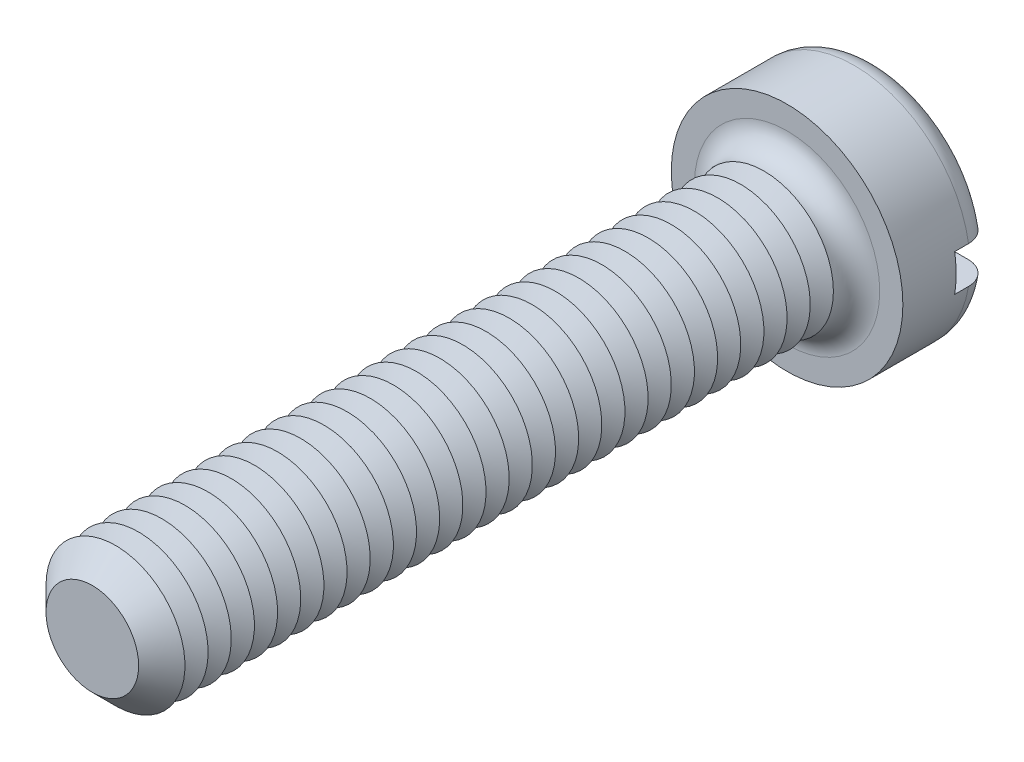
ISO-10303-21;
HEADER;
FILE_DESCRIPTION(('STEP AP214'),'2;1');
FILE_NAME('part.step','',(''),(''),'','','');
FILE_SCHEMA(('AUTOMOTIVE_DESIGN { 1 0 10303 214 1 1 1 1 }'));
ENDSEC;
DATA;
#1=APPLICATION_CONTEXT('core data for automotive mechanical design processes');
#2=APPLICATION_PROTOCOL_DEFINITION('international standard','automotive_design',2000,#1);
#3=PRODUCT_CONTEXT('',#1,'mechanical');
#4=PRODUCT('Part','Part','',(#3));
#5=PRODUCT_RELATED_PRODUCT_CATEGORY('part','',(#4));
#6=PRODUCT_DEFINITION_FORMATION('','',#4);
#7=PRODUCT_DEFINITION_CONTEXT('part definition',#1,'design');
#8=PRODUCT_DEFINITION('design','',#6,#7);
#9=PRODUCT_DEFINITION_SHAPE('','',#8);
#10=(LENGTH_UNIT() NAMED_UNIT(*) SI_UNIT(.MILLI.,.METRE.));
#11=(NAMED_UNIT(*) PLANE_ANGLE_UNIT() SI_UNIT($,.RADIAN.));
#12=(NAMED_UNIT(*) SI_UNIT($,.STERADIAN.) SOLID_ANGLE_UNIT());
#13=UNCERTAINTY_MEASURE_WITH_UNIT(LENGTH_MEASURE(1.E-05),#10,'distance_accuracy_value','');
#14=(GEOMETRIC_REPRESENTATION_CONTEXT(3) GLOBAL_UNCERTAINTY_ASSIGNED_CONTEXT((#13)) GLOBAL_UNIT_ASSIGNED_CONTEXT((#10,
#11,#12)) REPRESENTATION_CONTEXT('',''));
#15=CARTESIAN_POINT('',(0.,0.,0.));
#16=DIRECTION('',(0.,0.,1.));
#17=DIRECTION('',(1.,0.,0.));
#18=AXIS2_PLACEMENT_3D('',#15,#16,#17);
#19=CARTESIAN_POINT('',(0.,0.,-3.9));
#20=DIRECTION('',(0.,0.,1.));
#21=DIRECTION('',(1.,0.,0.));
#22=AXIS2_PLACEMENT_3D('',#19,#20,#21);
#23=PLANE('',#22);
#24=CARTESIAN_POINT('',(0.,0.,-3.9));
#25=DIRECTION('',(0.,0.,1.));
#26=DIRECTION('',(1.,0.,0.));
#27=AXIS2_PLACEMENT_3D('',#24,#25,#26);
#28=CIRCLE('',#27,4.);
#29=CARTESIAN_POINT('',(-3.91918358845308,0.800000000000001,-3.9));
#30=VERTEX_POINT('',#29);
#31=CARTESIAN_POINT('',(3.91918358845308,0.8,-3.9));
#32=VERTEX_POINT('',#31);
#33=EDGE_CURVE('E116',#30,#32,#28,.F.);
#34=ORIENTED_EDGE('',*,*,#33,.T.);
#35=DIRECTION('',(1.,0.,0.));
#36=VECTOR('',#35,1.);
#37=CARTESIAN_POINT('',(-5.,0.800000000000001,-3.9));
#38=LINE('',#37,#36);
#39=EDGE_CURVE('E111',#30,#32,#38,.T.);
#40=ORIENTED_EDGE('',*,*,#39,.F.);
#41=EDGE_LOOP('',(#34,#40));
#42=FACE_BOUND('',#41,.T.);
#43=ADVANCED_FACE('F39',(#42),#23,.F.);
#44=CARTESIAN_POINT('',(0.,0.,-2.9));
#45=DIRECTION('',(0.,0.,1.));
#46=DIRECTION('',(1.,0.,0.));
#47=AXIS2_PLACEMENT_3D('',#44,#45,#46);
#48=TOROIDAL_SURFACE('',#47,4.,1.);
#49=CARTESIAN_POINT('',(-4.76648512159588,0.800000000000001,-3.45304061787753));
#50=CARTESIAN_POINT('',(-4.73486405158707,0.800000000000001,-3.50001565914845));
#51=CARTESIAN_POINT('',(-4.69920787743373,0.800000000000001,-3.54432871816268));
#52=CARTESIAN_POINT('',(-4.62090302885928,0.800000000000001,-3.62634638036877));
#53=CARTESIAN_POINT('',(-4.57824494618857,0.800000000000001,-3.66404194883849));
#54=CARTESIAN_POINT('',(-4.48726975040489,0.800000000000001,-3.73172278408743));
#55=CARTESIAN_POINT('',(-4.43895902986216,0.800000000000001,-3.76171664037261));
#56=CARTESIAN_POINT('',(-4.33804923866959,0.800000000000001,-3.81326437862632));
#57=CARTESIAN_POINT('',(-4.2854512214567,0.800000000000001,-3.8348203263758));
#58=CARTESIAN_POINT('',(-4.17679895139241,0.800000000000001,-3.86918431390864));
#59=CARTESIAN_POINT('',(-4.12071163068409,0.800000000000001,-3.88188775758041));
#60=CARTESIAN_POINT('',(-4.00720729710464,0.800000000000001,-3.89785932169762));
#61=CARTESIAN_POINT('',(-3.94979011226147,0.800000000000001,-3.9011262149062));
#62=CARTESIAN_POINT('',(-3.83429042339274,0.800000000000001,-3.89816676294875));
#63=CARTESIAN_POINT('',(-3.77621176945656,0.800000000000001,-3.89178937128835));
#64=CARTESIAN_POINT('',(-3.66191938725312,0.800000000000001,-3.8694726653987));
#65=CARTESIAN_POINT('',(-3.60570580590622,0.800000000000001,-3.85353259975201));
#66=CARTESIAN_POINT('',(-3.49618749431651,0.800000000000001,-3.81233202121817));
#67=CARTESIAN_POINT('',(-3.44291561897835,0.800000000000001,-3.78698406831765));
#68=CARTESIAN_POINT('',(-3.34140774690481,0.800000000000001,-3.72766098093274));
#69=CARTESIAN_POINT('',(-3.29317182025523,0.800000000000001,-3.69368572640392));
#70=CARTESIAN_POINT('',(-3.20343355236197,0.800000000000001,-3.6182054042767));
#71=CARTESIAN_POINT('',(-3.16189680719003,0.800000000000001,-3.57674128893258));
#72=CARTESIAN_POINT('',(-3.08658236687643,0.800000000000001,-3.48727547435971));
#73=CARTESIAN_POINT('',(-3.05280364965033,0.800000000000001,-3.43927463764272));
#74=CARTESIAN_POINT('',(-2.99489532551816,0.800000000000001,-3.33932895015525));
#75=CARTESIAN_POINT('',(-2.97055012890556,0.800000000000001,-3.28750911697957));
#76=CARTESIAN_POINT('',(-2.93124252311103,0.800000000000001,-3.18042600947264));
#77=CARTESIAN_POINT('',(-2.91627793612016,0.800000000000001,-3.12516353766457));
#78=CARTESIAN_POINT('',(-2.89663075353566,0.800000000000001,-3.01470560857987));
#79=CARTESIAN_POINT('',(-2.89162828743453,0.800000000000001,-2.95956691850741));
#80=CARTESIAN_POINT('',(-2.89112479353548,0.800000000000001,-2.84924961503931));
#81=CARTESIAN_POINT('',(-2.89562264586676,0.800000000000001,-2.79407100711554));
#82=CARTESIAN_POINT('',(-2.91379565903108,0.800000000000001,-2.6861912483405));
#83=CARTESIAN_POINT('',(-2.92731815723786,0.800000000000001,-2.63346424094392));
#84=CARTESIAN_POINT('',(-2.96290888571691,0.800000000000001,-2.53098203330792));
#85=CARTESIAN_POINT('',(-2.98497757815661,0.800000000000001,-2.48122699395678));
#86=CARTESIAN_POINT('',(-3.03728055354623,0.800000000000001,-2.38535286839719));
#87=CARTESIAN_POINT('',(-3.06761989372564,0.800000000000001,-2.33929117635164));
#88=CARTESIAN_POINT('',(-3.13537950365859,0.800000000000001,-2.2527125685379));
#89=CARTESIAN_POINT('',(-3.17280082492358,0.800000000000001,-2.21219647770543));
#90=CARTESIAN_POINT('',(-3.2549164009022,0.800000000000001,-2.13651195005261));
#91=CARTESIAN_POINT('',(-3.29980186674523,0.800000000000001,-2.10155095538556));
#92=CARTESIAN_POINT('',(-3.39467666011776,0.800000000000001,-2.03942270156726));
#93=CARTESIAN_POINT('',(-3.44466673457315,0.800000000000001,-2.01225658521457));
#94=CARTESIAN_POINT('',(-3.5497933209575,0.800000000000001,-1.96576935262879));
#95=CARTESIAN_POINT('',(-3.60503228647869,0.800000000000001,-1.94667963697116));
#96=CARTESIAN_POINT('',(-3.71791613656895,0.800000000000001,-1.91794308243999));
#97=CARTESIAN_POINT('',(-3.77556119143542,0.800000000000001,-1.90829691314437));
#98=CARTESIAN_POINT('',(-3.89221522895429,0.800000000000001,-1.89869331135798));
#99=CARTESIAN_POINT('',(-3.9512319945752,0.800000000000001,-1.89882985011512));
#100=CARTESIAN_POINT('',(-4.06839541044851,0.800000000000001,-1.90907818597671));
#101=CARTESIAN_POINT('',(-4.12654207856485,0.800000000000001,-1.91918977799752));
#102=CARTESIAN_POINT('',(-4.23988103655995,0.800000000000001,-1.9490667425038));
#103=CARTESIAN_POINT('',(-4.29509069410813,0.800000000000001,-1.96876615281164));
#104=CARTESIAN_POINT('',(-4.40134194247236,0.800000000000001,-2.01729572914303));
#105=CARTESIAN_POINT('',(-4.45238383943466,0.800000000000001,-2.04612522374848));
#106=CARTESIAN_POINT('',(-4.54801343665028,0.800000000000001,-2.1116316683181));
#107=CARTESIAN_POINT('',(-4.59268768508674,0.800000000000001,-2.14818225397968));
#108=CARTESIAN_POINT('',(-4.67513924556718,0.800000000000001,-2.22837632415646));
#109=CARTESIAN_POINT('',(-4.71291715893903,0.800000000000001,-2.27201918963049));
#110=CARTESIAN_POINT('',(-4.77986554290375,0.800000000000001,-2.36439990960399));
#111=CARTESIAN_POINT('',(-4.80916462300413,0.800000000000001,-2.41304457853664));
#112=CARTESIAN_POINT('',(-4.85906149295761,0.800000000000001,-2.51460659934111));
#113=CARTESIAN_POINT('',(-4.8796602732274,0.800000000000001,-2.56752346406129));
#114=CARTESIAN_POINT('',(-4.9113264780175,0.800000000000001,-2.67542592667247));
#115=CARTESIAN_POINT('',(-4.92250819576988,0.800000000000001,-2.73037800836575));
#116=CARTESIAN_POINT('',(-4.93542682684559,0.800000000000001,-2.84139649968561));
#117=CARTESIAN_POINT('',(-4.93716171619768,0.800000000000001,-2.89746314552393));
#118=CARTESIAN_POINT('',(-4.93114851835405,0.800000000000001,-3.00876455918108));
#119=CARTESIAN_POINT('',(-4.92345325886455,0.800000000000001,-3.0640022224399));
#120=CARTESIAN_POINT('',(-4.8989032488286,0.800000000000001,-3.17235240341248));
#121=CARTESIAN_POINT('',(-4.88205998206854,0.800000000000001,-3.22546749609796));
#122=CARTESIAN_POINT('',(-4.84819200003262,0.800000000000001,-3.30764066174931));
#123=CARTESIAN_POINT('',(-4.83390853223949,0.800000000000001,-3.33785845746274));
#124=CARTESIAN_POINT('',(-4.80237957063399,0.800000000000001,-3.39670633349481));
#125=CARTESIAN_POINT('',(-4.78513409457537,0.800000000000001,-3.42533642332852));
#126=CARTESIAN_POINT('',(-4.76648512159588,0.800000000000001,-3.45304061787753));
#127=B_SPLINE_CURVE_WITH_KNOTS('',3,(#49,#50,#51,#52,#53,#54,#55,#56,#57,#58,#59,#60,#61,#62,
#63,#64,#65,#66,#67,#68,#69,#70,#71,#72,#73,#74,#75,#76,#77,#78,#79,#80,#81,#82,#83,#84,#85,#86,
#87,#88,#89,#90,#91,#92,#93,#94,#95,#96,#97,#98,#99,#100,#101,#102,#103,#104,#105,#106,#107,
#108,#109,#110,#111,#112,#113,#114,#115,#116,#117,#118,#119,#120,#121,#122,#123,#124,#125,#126),
.UNSPECIFIED.,.T.,.F.,(4,2,2,2,2,2,2,2,2,2,2,2,2,2,2,2,2,2,2,2,2,2,2,2,2,2,2,2,2,2,2,2,2,2,2,2,
2,2,4),(0.,0.169755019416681,0.339740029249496,0.509534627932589,0.67928763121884,
0.851013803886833,1.02276230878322,1.19722869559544,1.37170879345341,1.54785292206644,
1.72399950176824,1.89921049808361,2.07439839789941,2.24530597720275,2.41617386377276,
2.58146078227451,2.74672821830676,2.90926852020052,3.0718176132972,3.2365363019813,
3.40127946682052,3.57118676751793,3.74111896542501,3.91563534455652,4.09016409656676,
4.26636956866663,4.4425714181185,4.61757781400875,4.79257134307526,4.96489650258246,
5.13720662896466,5.30674670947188,5.47626748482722,5.64369988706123,5.81116816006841,
5.97770254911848,6.14402836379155,6.24414438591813,6.34425980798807),.UNSPECIFIED.);
#128=CARTESIAN_POINT('',(-4.93558507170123,0.800000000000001,-2.9));
#129=VERTEX_POINT('',#128);
#130=EDGE_CURVE('E403',#129,#30,#127,.T.);
#131=ORIENTED_EDGE('',*,*,#130,.F.);
#132=CARTESIAN_POINT('',(0.,0.,-2.9));
#133=DIRECTION('',(0.,0.,1.));
#134=DIRECTION('',(1.,0.,0.));
#135=AXIS2_PLACEMENT_3D('',#132,#133,#134);
#136=CIRCLE('',#135,5.);
#137=CARTESIAN_POINT('',(4.93558507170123,0.8,-2.9));
#138=VERTEX_POINT('',#137);
#139=EDGE_CURVE('E125',#138,#129,#136,.T.);
#140=ORIENTED_EDGE('',*,*,#139,.F.);
#141=CARTESIAN_POINT('',(2.98553785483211,0.8,-3.31649797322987));
#142=CARTESIAN_POINT('',(3.00991125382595,0.8,-3.36788093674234));
#143=CARTESIAN_POINT('',(3.03875556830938,0.8,-3.41719756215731));
#144=CARTESIAN_POINT('',(3.1043993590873,0.8,-3.51028676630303));
#145=CARTESIAN_POINT('',(3.1412115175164,0.8,-3.55405032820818));
#146=CARTESIAN_POINT('',(3.22153641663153,0.8,-3.63476402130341));
#147=CARTESIAN_POINT('',(3.26503706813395,0.8,-3.67172618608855));
#148=CARTESIAN_POINT('',(3.35749627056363,0.8,-3.73799476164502));
#149=CARTESIAN_POINT('',(3.4064533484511,0.8,-3.76730323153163));
#150=CARTESIAN_POINT('',(3.5095773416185,0.8,-3.81809642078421));
#151=CARTESIAN_POINT('',(3.56383317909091,0.8,-3.83940072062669));
#152=CARTESIAN_POINT('',(3.67513017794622,0.8,-3.87272481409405));
#153=CARTESIAN_POINT('',(3.7321717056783,0.8,-3.88474338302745));
#154=CARTESIAN_POINT('',(3.84815688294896,0.8,-3.89923413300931));
#155=CARTESIAN_POINT('',(3.90711516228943,0.8,-3.9015896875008));
#156=CARTESIAN_POINT('',(4.02458610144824,0.8,-3.89631753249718));
#157=CARTESIAN_POINT('',(4.08309876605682,0.8,-3.8886899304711));
#158=CARTESIAN_POINT('',(4.19768646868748,0.8,-3.86366584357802));
#159=CARTESIAN_POINT('',(4.25377243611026,0.8,-3.84631948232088));
#160=CARTESIAN_POINT('',(4.3621676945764,0.8,-3.80231797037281));
#161=CARTESIAN_POINT('',(4.41447726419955,0.8,-3.77566350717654));
#162=CARTESIAN_POINT('',(4.51300872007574,0.8,-3.71421163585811));
#163=CARTESIAN_POINT('',(4.5593085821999,0.8,-3.67953927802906));
#164=CARTESIAN_POINT('',(4.64530675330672,0.8,-3.60279495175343));
#165=CARTESIAN_POINT('',(4.68500564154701,0.8,-3.56072363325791));
#166=CARTESIAN_POINT('',(4.75599202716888,0.8,-3.47111750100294));
#167=CARTESIAN_POINT('',(4.7874061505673,0.8,-3.42368298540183));
#168=CARTESIAN_POINT('',(4.84170328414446,0.8,-3.32415927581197));
#169=CARTESIAN_POINT('',(4.86458695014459,0.8,-3.2720704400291));
#170=CARTESIAN_POINT('',(4.90088120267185,0.8,-3.16544016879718));
#171=CARTESIAN_POINT('',(4.91440984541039,0.8,-3.11093889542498));
#172=CARTESIAN_POINT('',(4.93205429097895,0.8,-3.00043391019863));
#173=CARTESIAN_POINT('',(4.93617053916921,0.8,-2.9444302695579));
#174=CARTESIAN_POINT('',(4.93486973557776,0.8,-2.83292218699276));
#175=CARTESIAN_POINT('',(4.92951827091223,0.8,-2.77741696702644));
#176=CARTESIAN_POINT('',(4.90957104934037,0.8,-2.66809456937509));
#177=CARTESIAN_POINT('',(4.89497541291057,0.8,-2.61427736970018));
#178=CARTESIAN_POINT('',(4.85697876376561,0.8,-2.50985095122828));
#179=CARTESIAN_POINT('',(4.83357805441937,0.8,-2.45924162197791));
#180=CARTESIAN_POINT('',(4.77866660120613,0.8,-2.36263484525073));
#181=CARTESIAN_POINT('',(4.74715567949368,0.8,-2.31663749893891));
#182=CARTESIAN_POINT('',(4.67670791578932,0.8,-2.23021464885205));
#183=CARTESIAN_POINT('',(4.6377224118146,0.8,-2.1898288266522));
#184=CARTESIAN_POINT('',(4.55359880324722,0.8,-2.11607828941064));
#185=CARTESIAN_POINT('',(4.50846036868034,0.8,-2.08271395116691));
#186=CARTESIAN_POINT('',(4.41271544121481,0.8,-2.02349513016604));
#187=CARTESIAN_POINT('',(4.36204749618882,0.8,-1.99774003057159));
#188=CARTESIAN_POINT('',(4.257155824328,0.8,-1.95495040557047));
#189=CARTESIAN_POINT('',(4.20293181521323,0.8,-1.93791657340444));
#190=CARTESIAN_POINT('',(4.09154156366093,0.8,-1.91276335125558));
#191=CARTESIAN_POINT('',(4.03434212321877,0.8,-1.90479098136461));
#192=CARTESIAN_POINT('',(3.91941228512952,0.8,-1.89840884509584));
#193=CARTESIAN_POINT('',(3.8616818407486,0.8,-1.89999992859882));
#194=CARTESIAN_POINT('',(3.7464111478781,0.8,-1.91275144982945));
#195=CARTESIAN_POINT('',(3.6888866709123,0.8,-1.92405471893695));
#196=CARTESIAN_POINT('',(3.57652290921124,0.8,-1.95609086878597));
#197=CARTESIAN_POINT('',(3.52168382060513,0.8,-1.97682443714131));
#198=CARTESIAN_POINT('',(3.41589179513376,0.8,-2.02733294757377));
#199=CARTESIAN_POINT('',(3.36496676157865,0.8,-2.05716640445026));
#200=CARTESIAN_POINT('',(3.26890903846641,0.8,-2.12504079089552));
#201=CARTESIAN_POINT('',(3.22377627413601,0.8,-2.16308161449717));
#202=CARTESIAN_POINT('',(3.141135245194,0.8,-2.24593284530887));
#203=CARTESIAN_POINT('',(3.1035541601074,0.8,-2.29067053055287));
#204=CARTESIAN_POINT('',(3.03669700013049,0.8,-2.38597317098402));
#205=CARTESIAN_POINT('',(3.00741914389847,0.8,-2.43653687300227));
#206=CARTESIAN_POINT('',(2.95891799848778,0.8,-2.54052959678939));
#207=CARTESIAN_POINT('',(2.93943249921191,0.8,-2.59383627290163));
#208=CARTESIAN_POINT('',(2.9100081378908,0.8,-2.70303736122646));
#209=CARTESIAN_POINT('',(2.90006970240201,0.8,-2.75893188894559));
#210=CARTESIAN_POINT('',(2.89027863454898,0.8,-2.86986958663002));
#211=CARTESIAN_POINT('',(2.89012791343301,0.8,-2.92488680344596));
#212=CARTESIAN_POINT('',(2.89917145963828,0.8,-3.03409648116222));
#213=CARTESIAN_POINT('',(2.90835313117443,0.8,-3.08828995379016));
#214=CARTESIAN_POINT('',(2.92977618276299,0.8,-3.17141652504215));
#215=CARTESIAN_POINT('',(2.93899011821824,0.8,-3.20116372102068));
#216=CARTESIAN_POINT('',(2.96020249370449,0.8,-3.25964614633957));
#217=CARTESIAN_POINT('',(2.97220082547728,0.8,-3.28838141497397));
#218=CARTESIAN_POINT('',(2.98553785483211,0.8,-3.31649797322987));
#219=B_SPLINE_CURVE_WITH_KNOTS('',3,(#141,#142,#143,#144,#145,#146,#147,#148,#149,#150,#151,
#152,#153,#154,#155,#156,#157,#158,#159,#160,#161,#162,#163,#164,#165,#166,#167,#168,#169,#170,
#171,#172,#173,#174,#175,#176,#177,#178,#179,#180,#181,#182,#183,#184,#185,#186,#187,#188,#189,
#190,#191,#192,#193,#194,#195,#196,#197,#198,#199,#200,#201,#202,#203,#204,#205,#206,#207,#208,
#209,#210,#211,#212,#213,#214,#215,#216,#217,#218),.UNSPECIFIED.,.T.,.F.,(4,2,2,2,2,2,2,2,2,2,2,
2,2,2,2,2,2,2,2,2,2,2,2,2,2,2,2,2,2,2,2,2,2,2,2,2,2,2,4),(0.,0.170493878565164,
0.341261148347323,0.511723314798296,0.682139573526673,0.856194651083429,1.03027268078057,
1.20644565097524,1.38261672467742,1.55788746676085,1.73314526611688,1.90583484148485,
2.07850925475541,2.24836742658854,2.41821253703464,2.58587311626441,2.75352576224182,
2.92002154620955,3.08651516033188,3.25300303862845,3.41949456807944,3.58710926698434,
3.75473295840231,3.92445790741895,4.09419634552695,4.26665110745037,4.43912119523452,
4.61417197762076,4.78923552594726,4.96544940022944,5.1416609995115,5.31608191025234,
5.49046537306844,5.65989063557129,5.82932346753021,5.99359365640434,6.157642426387,
6.250939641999,6.34423323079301),.UNSPECIFIED.);
#220=EDGE_CURVE('E405',#32,#138,#219,.T.);
#221=ORIENTED_EDGE('',*,*,#220,.F.);
#222=ORIENTED_EDGE('',*,*,#33,.F.);
#223=EDGE_LOOP('',(#131,#140,#221,#222));
#224=FACE_BOUND('',#223,.T.);
#225=ADVANCED_FACE('F387',(#224),#48,.T.);
#226=CARTESIAN_POINT('',(0.,0.,-3.9));
#227=DIRECTION('',(0.,0.,1.));
#228=DIRECTION('',(1.,0.,0.));
#229=AXIS2_PLACEMENT_3D('',#226,#227,#228);
#230=CYLINDRICAL_SURFACE('',#229,5.);
#231=DIRECTION('',(0.,0.,1.));
#232=VECTOR('',#231,1.);
#233=CARTESIAN_POINT('',(4.93558507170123,0.8,-3.9));
#234=LINE('',#233,#232);
#235=CARTESIAN_POINT('',(4.93558507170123,0.8,-2.3));
#236=VERTEX_POINT('',#235);
#237=EDGE_CURVE('E420',#138,#236,#234,.T.);
#238=ORIENTED_EDGE('',*,*,#237,.F.);
#239=ORIENTED_EDGE('',*,*,#139,.T.);
#240=DIRECTION('',(0.,0.,1.));
#241=VECTOR('',#240,1.);
#242=CARTESIAN_POINT('',(-4.93558507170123,0.800000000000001,-3.9));
#243=LINE('',#242,#241);
#244=CARTESIAN_POINT('',(-4.93558507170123,0.800000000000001,-2.3));
#245=VERTEX_POINT('',#244);
#246=EDGE_CURVE('E63',#245,#129,#243,.F.);
#247=ORIENTED_EDGE('',*,*,#246,.F.);
#248=CARTESIAN_POINT('',(0.,0.,-2.3));
#249=DIRECTION('',(0.,0.,-1.));
#250=DIRECTION('',(-1.,0.,0.));
#251=AXIS2_PLACEMENT_3D('',#248,#249,#250);
#252=CIRCLE('',#251,5.);
#253=CARTESIAN_POINT('',(-4.93558507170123,-0.799999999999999,-2.3));
#254=VERTEX_POINT('',#253);
#255=EDGE_CURVE('E43',#245,#254,#252,.F.);
#256=ORIENTED_EDGE('',*,*,#255,.T.);
#257=DIRECTION('',(0.,0.,1.));
#258=VECTOR('',#257,1.);
#259=CARTESIAN_POINT('',(-4.93558507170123,-0.799999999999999,-3.9));
#260=LINE('',#259,#258);
#261=CARTESIAN_POINT('',(-4.93558507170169,-0.799999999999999,-2.89999999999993));
#262=VERTEX_POINT('',#261);
#263=EDGE_CURVE('E417',#262,#254,#260,.T.);
#264=ORIENTED_EDGE('',*,*,#263,.F.);
#265=CARTESIAN_POINT('',(4.93558507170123,-0.8,-2.9));
#266=VERTEX_POINT('',#265);
#267=EDGE_CURVE('E127',#262,#266,#136,.T.);
#268=ORIENTED_EDGE('',*,*,#267,.T.);
#269=DIRECTION('',(0.,0.,1.));
#270=VECTOR('',#269,1.);
#271=CARTESIAN_POINT('',(4.93558507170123,-0.8,-3.9));
#272=LINE('',#271,#270);
#273=CARTESIAN_POINT('',(4.93558507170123,-0.8,-2.3));
#274=VERTEX_POINT('',#273);
#275=EDGE_CURVE('E55',#274,#266,#272,.F.);
#276=ORIENTED_EDGE('',*,*,#275,.F.);
#277=EDGE_CURVE('E11',#274,#236,#252,.F.);
#278=ORIENTED_EDGE('',*,*,#277,.T.);
#279=EDGE_LOOP('',(#238,#239,#247,#256,#264,#268,#276,#278));
#280=FACE_BOUND('',#279,.T.);
#281=CARTESIAN_POINT('',(0.,0.,0.));
#282=DIRECTION('',(0.,0.,1.));
#283=DIRECTION('',(1.,0.,0.));
#284=AXIS2_PLACEMENT_3D('',#281,#282,#283);
#285=CIRCLE('',#284,5.);
#286=CARTESIAN_POINT('',(5.,0.,0.));
#287=VERTEX_POINT('',#286);
#288=EDGE_CURVE('E423',#287,#287,#285,.T.);
#289=ORIENTED_EDGE('',*,*,#288,.F.);
#290=EDGE_LOOP('',(#289));
#291=FACE_BOUND('',#290,.T.);
#292=ADVANCED_FACE('F383',(#280,#291),#230,.T.);
#293=CARTESIAN_POINT('',(3.91918358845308,-0.8,-3.9));
#294=VERTEX_POINT('',#293);
#295=CARTESIAN_POINT('',(-3.91918358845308,-0.799999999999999,-3.9));
#296=VERTEX_POINT('',#295);
#297=EDGE_CURVE('E109',#294,#296,#28,.F.);
#298=ORIENTED_EDGE('',*,*,#297,.T.);
#299=DIRECTION('',(-1.,0.,0.));
#300=VECTOR('',#299,1.);
#301=CARTESIAN_POINT('',(-5.,-0.799999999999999,-3.9));
#302=LINE('',#301,#300);
#303=EDGE_CURVE('E96',#294,#296,#302,.T.);
#304=ORIENTED_EDGE('',*,*,#303,.F.);
#305=EDGE_LOOP('',(#298,#304));
#306=FACE_BOUND('',#305,.T.);
#307=ADVANCED_FACE('F108',(#306),#23,.F.);
#308=CARTESIAN_POINT('',(0.,0.,0.));
#309=DIRECTION('',(0.,0.,1.));
#310=DIRECTION('',(1.,0.,0.));
#311=AXIS2_PLACEMENT_3D('',#308,#309,#310);
#312=PLANE('',#311);
#313=CARTESIAN_POINT('',(0.,0.,0.));
#314=DIRECTION('',(0.,0.,1.));
#315=DIRECTION('',(1.,0.,0.));
#316=AXIS2_PLACEMENT_3D('',#313,#314,#315);
#317=CIRCLE('',#316,4.);
#318=CARTESIAN_POINT('',(4.,0.,0.));
#319=VERTEX_POINT('',#318);
#320=EDGE_CURVE('E115',#319,#319,#317,.F.);
#321=ORIENTED_EDGE('',*,*,#320,.T.);
#322=EDGE_LOOP('',(#321));
#323=FACE_BOUND('',#322,.T.);
#324=ORIENTED_EDGE('',*,*,#288,.T.);
#325=EDGE_LOOP('',(#324));
#326=FACE_BOUND('',#325,.T.);
#327=ADVANCED_FACE('F382',(#323,#326),#312,.T.);
#328=CARTESIAN_POINT('',(-4.76648512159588,-0.799999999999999,-3.45304061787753));
#329=CARTESIAN_POINT('',(-4.7975694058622,-0.799999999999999,-3.40685392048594));
#330=CARTESIAN_POINT('',(-4.82479903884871,-0.799999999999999,-3.35802740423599));
#331=CARTESIAN_POINT('',(-4.87070632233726,-0.799999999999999,-3.25646127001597));
#332=CARTESIAN_POINT('',(-4.8893747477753,-0.799999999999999,-3.20371750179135));
#333=CARTESIAN_POINT('',(-4.91756720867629,-0.799999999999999,-3.09584501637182));
#334=CARTESIAN_POINT('',(-4.92709302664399,-0.799999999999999,-3.04071676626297));
#335=CARTESIAN_POINT('',(-4.93671217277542,-0.799999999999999,-2.92965669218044));
#336=CARTESIAN_POINT('',(-4.93680767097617,-0.799999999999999,-2.87372505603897));
#337=CARTESIAN_POINT('',(-4.92758675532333,-0.799999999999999,-2.76284675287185));
#338=CARTESIAN_POINT('',(-4.91830421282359,-0.799999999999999,-2.70789726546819));
#339=CARTESIAN_POINT('',(-4.89065741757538,-0.799999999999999,-2.60033228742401));
#340=CARTESIAN_POINT('',(-4.87229291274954,-0.799999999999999,-2.54771686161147));
#341=CARTESIAN_POINT('',(-4.82699855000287,-0.799999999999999,-2.44622441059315));
#342=CARTESIAN_POINT('',(-4.80005659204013,-0.799999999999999,-2.39735278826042));
#343=CARTESIAN_POINT('',(-4.73841244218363,-0.799999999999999,-2.30477947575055));
#344=CARTESIAN_POINT('',(-4.70371003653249,-0.799999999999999,-2.26107792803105));
#345=CARTESIAN_POINT('',(-4.62724516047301,-0.799999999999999,-2.17969334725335));
#346=CARTESIAN_POINT('',(-4.58542787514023,-0.799999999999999,-2.14206183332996));
#347=CARTESIAN_POINT('',(-4.49614171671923,-0.799999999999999,-2.07424284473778));
#348=CARTESIAN_POINT('',(-4.44867251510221,-0.799999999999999,-2.04405580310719));
#349=CARTESIAN_POINT('',(-4.34875035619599,-0.799999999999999,-1.99153688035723));
#350=CARTESIAN_POINT('',(-4.29623870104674,-0.799999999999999,-1.96931670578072));
#351=CARTESIAN_POINT('',(-4.18826905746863,-0.799999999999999,-1.93384994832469));
#352=CARTESIAN_POINT('',(-4.1328108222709,-0.799999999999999,-1.92060411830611));
#353=CARTESIAN_POINT('',(-4.01956054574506,-0.799999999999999,-1.90323798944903));
#354=CARTESIAN_POINT('',(-3.96174522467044,-0.799999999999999,-1.89926947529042));
#355=CARTESIAN_POINT('',(-3.84625419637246,-0.799999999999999,-1.90095183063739));
#356=CARTESIAN_POINT('',(-3.78857850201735,-0.799999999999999,-1.90660355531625));
#357=CARTESIAN_POINT('',(-3.67415602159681,-0.799999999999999,-1.92748272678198));
#358=CARTESIAN_POINT('',(-3.61743328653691,-0.799999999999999,-1.94284216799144));
#359=CARTESIAN_POINT('',(-3.50734962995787,-0.799999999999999,-1.9828275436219));
#360=CARTESIAN_POINT('',(-3.4539889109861,-0.799999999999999,-2.00745403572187));
#361=CARTESIAN_POINT('',(-3.35197118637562,-0.799999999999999,-2.06542964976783));
#362=CARTESIAN_POINT('',(-3.30333217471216,-0.799999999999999,-2.0988104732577));
#363=CARTESIAN_POINT('',(-3.21244692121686,-0.799999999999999,-2.17337326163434));
#364=CARTESIAN_POINT('',(-3.17020039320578,-0.799999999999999,-2.21455487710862));
#365=CARTESIAN_POINT('',(-3.0940098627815,-0.799999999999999,-2.30296695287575));
#366=CARTESIAN_POINT('',(-3.05995540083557,-0.799999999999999,-2.35010211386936));
#367=CARTESIAN_POINT('',(-3.00053815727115,-0.799999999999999,-2.4495670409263));
#368=CARTESIAN_POINT('',(-2.97517362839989,-0.799999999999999,-2.50189576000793));
#369=CARTESIAN_POINT('',(-2.93470320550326,-0.799999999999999,-2.60853979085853));
#370=CARTESIAN_POINT('',(-2.91930557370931,-0.799999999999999,-2.66274437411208));
#371=CARTESIAN_POINT('',(-2.89812734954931,-0.799999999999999,-2.77299836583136));
#372=CARTESIAN_POINT('',(-2.89234481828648,-0.799999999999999,-2.82904740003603));
#373=CARTESIAN_POINT('',(-2.89064073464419,-0.799999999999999,-2.93970612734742));
#374=CARTESIAN_POINT('',(-2.89444549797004,-0.799999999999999,-2.99431180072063));
#375=CARTESIAN_POINT('',(-2.9112006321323,-0.799999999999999,-3.10209766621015));
#376=CARTESIAN_POINT('',(-2.9241507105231,-0.799999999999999,-3.1552779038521));
#377=CARTESIAN_POINT('',(-2.95868580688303,-0.799999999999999,-3.25858631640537));
#378=CARTESIAN_POINT('',(-2.98024709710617,-0.799999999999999,-3.30872244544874));
#379=CARTESIAN_POINT('',(-3.03128544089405,-0.799999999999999,-3.40478519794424));
#380=CARTESIAN_POINT('',(-3.06076335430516,-0.799999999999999,-3.45071136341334));
#381=CARTESIAN_POINT('',(-3.12753448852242,-0.799999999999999,-3.53826932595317));
#382=CARTESIAN_POINT('',(-3.16500083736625,-0.799999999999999,-3.57976901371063));
#383=CARTESIAN_POINT('',(-3.24617503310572,-0.799999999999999,-3.65613204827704));
#384=CARTESIAN_POINT('',(-3.28988388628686,-0.799999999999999,-3.69099432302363));
#385=CARTESIAN_POINT('',(-3.38380639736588,-0.799999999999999,-3.75424083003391));
#386=CARTESIAN_POINT('',(-3.43418287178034,-0.799999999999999,-3.78238342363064));
#387=CARTESIAN_POINT('',(-3.53887888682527,-0.799999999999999,-3.83000231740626));
#388=CARTESIAN_POINT('',(-3.59319889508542,-0.799999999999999,-3.84947758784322));
#389=CARTESIAN_POINT('',(-3.70539237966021,-0.799999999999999,-3.87954336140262));
#390=CARTESIAN_POINT('',(-3.76331464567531,-0.799999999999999,-3.88995217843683));
#391=CARTESIAN_POINT('',(-3.88008461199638,-0.799999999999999,-3.9009132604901));
#392=CARTESIAN_POINT('',(-3.93893230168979,-0.799999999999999,-3.9014656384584));
#393=CARTESIAN_POINT('',(-4.05594892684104,-0.799999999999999,-3.89264187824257));
#394=CARTESIAN_POINT('',(-4.11411702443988,-0.799999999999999,-3.88325457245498));
#395=CARTESIAN_POINT('',(-4.22802928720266,-0.799999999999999,-3.85472582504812));
#396=CARTESIAN_POINT('',(-4.28377297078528,-0.799999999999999,-3.83558245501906));
#397=CARTESIAN_POINT('',(-4.39054463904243,-0.799999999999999,-3.78829842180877));
#398=CARTESIAN_POINT('',(-4.44161887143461,-0.799999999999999,-3.76026208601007));
#399=CARTESIAN_POINT('',(-4.53818016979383,-0.799999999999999,-3.69589278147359));
#400=CARTESIAN_POINT('',(-4.58367442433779,-0.799999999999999,-3.65957066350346));
#401=CARTESIAN_POINT('',(-4.65208830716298,-0.799999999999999,-3.59453310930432));
#402=CARTESIAN_POINT('',(-4.67711825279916,-0.799999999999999,-3.56800018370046));
#403=CARTESIAN_POINT('',(-4.72414423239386,-0.799999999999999,-3.51236863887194));
#404=CARTESIAN_POINT('',(-4.74614029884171,-0.799999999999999,-3.48327004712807));
#405=CARTESIAN_POINT('',(-4.76648512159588,-0.799999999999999,-3.45304061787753));
#406=B_SPLINE_CURVE_WITH_KNOTS('',3,(#328,#329,#330,#331,#332,#333,#334,#335,#336,#337,#338,
#339,#340,#341,#342,#343,#344,#345,#346,#347,#348,#349,#350,#351,#352,#353,#354,#355,#356,#357,
#358,#359,#360,#361,#362,#363,#364,#365,#366,#367,#368,#369,#370,#371,#372,#373,#374,#375,#376,
#377,#378,#379,#380,#381,#382,#383,#384,#385,#386,#387,#388,#389,#390,#391,#392,#393,#394,#395,
#396,#397,#398,#399,#400,#401,#402,#403,#404,#405),.UNSPECIFIED.,.T.,.F.,(4,2,2,2,2,2,2,2,2,2,2,
2,2,2,2,2,2,2,2,2,2,2,2,2,2,2,2,2,2,2,2,2,2,2,2,2,2,2,4),(0.,0.166886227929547,
0.333951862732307,0.500984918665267,0.667979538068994,0.834373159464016,1.00077139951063,
1.16740542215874,1.33404403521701,1.50202999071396,1.67002571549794,1.84029248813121,
2.01057354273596,2.18362161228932,2.35668506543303,2.53215380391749,2.70763310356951,
2.88375684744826,3.05987270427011,3.23346085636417,3.40701408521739,3.57522519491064,
3.74340238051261,3.90683338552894,4.0702591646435,4.23323770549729,4.39623395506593,
4.56320691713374,4.7302068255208,4.90252468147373,5.07486300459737,5.25058028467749,
5.42629555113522,5.60220844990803,5.77815613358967,5.95211162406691,6.12584060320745,
6.23506966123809,6.34429754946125),.UNSPECIFIED.);
#407=EDGE_CURVE('E103',#296,#262,#406,.T.);
#408=ORIENTED_EDGE('',*,*,#407,.F.);
#409=ORIENTED_EDGE('',*,*,#297,.F.);
#410=CARTESIAN_POINT('',(2.98553785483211,-0.8,-3.31649797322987));
#411=CARTESIAN_POINT('',(2.96216773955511,-0.8,-3.26721849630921));
#412=CARTESIAN_POINT('',(2.94287503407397,-0.8,-3.21596872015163));
#413=CARTESIAN_POINT('',(2.91313258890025,-0.8,-3.11092723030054));
#414=CARTESIAN_POINT('',(2.9026902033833,-0.8,-3.0571334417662));
#415=CARTESIAN_POINT('',(2.89104377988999,-0.8,-2.94853922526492));
#416=CARTESIAN_POINT('',(2.88984130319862,-0.8,-2.89373862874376));
#417=CARTESIAN_POINT('',(2.89672585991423,-0.8,-2.78473646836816));
#418=CARTESIAN_POINT('',(2.90481120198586,-0.8,-2.73053479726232));
#419=CARTESIAN_POINT('',(2.92989134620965,-0.8,-2.62460092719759));
#420=CARTESIAN_POINT('',(2.94682969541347,-0.8,-2.57285532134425));
#421=CARTESIAN_POINT('',(2.9889990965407,-0.8,-2.47286425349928));
#422=CARTESIAN_POINT('',(3.01423103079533,-0.8,-2.42461916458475));
#423=CARTESIAN_POINT('',(3.07271536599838,-0.8,-2.33201565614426));
#424=CARTESIAN_POINT('',(3.10610710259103,-0.8,-2.28774532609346));
#425=CARTESIAN_POINT('',(3.17963417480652,-0.8,-2.205215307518));
#426=CARTESIAN_POINT('',(3.21977054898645,-0.8,-2.16695654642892));
#427=CARTESIAN_POINT('',(3.3070361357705,-0.8,-2.09624274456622));
#428=CARTESIAN_POINT('',(3.35434874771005,-0.8,-2.06401396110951));
#429=CARTESIAN_POINT('',(3.45361131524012,-0.8,-2.00773436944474));
#430=CARTESIAN_POINT('',(3.50556189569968,-0.8,-1.98368466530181));
#431=CARTESIAN_POINT('',(3.61398433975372,-0.8,-1.94389460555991));
#432=CARTESIAN_POINT('',(3.67053506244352,-0.8,-1.92836880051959));
#433=CARTESIAN_POINT('',(3.78543606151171,-0.8,-1.90696594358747));
#434=CARTESIAN_POINT('',(3.84378643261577,-0.8,-1.90108940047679));
#435=CARTESIAN_POINT('',(3.96100201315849,-0.8,-1.89918115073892));
#436=CARTESIAN_POINT('',(4.01986821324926,-0.8,-1.90320860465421));
#437=CARTESIAN_POINT('',(4.13606891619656,-0.8,-1.9211820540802));
#438=CARTESIAN_POINT('',(4.19340347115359,-0.8,-1.93512771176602));
#439=CARTESIAN_POINT('',(4.30434213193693,-0.8,-1.97243705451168));
#440=CARTESIAN_POINT('',(4.35797549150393,-0.8,-1.99571368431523));
#441=CARTESIAN_POINT('',(4.46048254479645,-0.8,-2.0510826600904));
#442=CARTESIAN_POINT('',(4.50935662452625,-0.8,-2.08317429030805));
#443=CARTESIAN_POINT('',(4.60012348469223,-0.8,-2.15471647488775));
#444=CARTESIAN_POINT('',(4.64211506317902,-0.8,-2.19404167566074));
#445=CARTESIAN_POINT('',(4.71877054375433,-0.8,-2.27928299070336));
#446=CARTESIAN_POINT('',(4.75343508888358,-0.8,-2.32519852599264));
#447=CARTESIAN_POINT('',(4.81388799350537,-0.8,-2.4215411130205));
#448=CARTESIAN_POINT('',(4.83980652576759,-0.8,-2.47188650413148));
#449=CARTESIAN_POINT('',(4.88271402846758,-0.8,-2.57624865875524));
#450=CARTESIAN_POINT('',(4.89970360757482,-0.8,-2.63026517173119));
#451=CARTESIAN_POINT('',(4.92409334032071,-0.8,-2.73978844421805));
#452=CARTESIAN_POINT('',(4.93159814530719,-0.8,-2.79527191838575));
#453=CARTESIAN_POINT('',(4.93713723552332,-0.8,-2.90670881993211));
#454=CARTESIAN_POINT('',(4.9351718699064,-0.8,-2.9626622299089));
#455=CARTESIAN_POINT('',(4.92186293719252,-0.8,-3.07317093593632));
#456=CARTESIAN_POINT('',(4.91056393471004,-0.8,-3.12773160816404));
#457=CARTESIAN_POINT('',(4.87898532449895,-0.8,-3.234187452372));
#458=CARTESIAN_POINT('',(4.85870572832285,-0.8,-3.28608262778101));
#459=CARTESIAN_POINT('',(4.80971634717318,-0.8,-3.38586723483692));
#460=CARTESIAN_POINT('',(4.78098824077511,-0.8,-3.43374766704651));
#461=CARTESIAN_POINT('',(4.71596686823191,-0.8,-3.52405937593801));
#462=CARTESIAN_POINT('',(4.67967336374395,-0.8,-3.56649048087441));
#463=CARTESIAN_POINT('',(4.60022577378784,-0.8,-3.64511036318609));
#464=CARTESIAN_POINT('',(4.5570143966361,-0.8,-3.6812412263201));
#465=CARTESIAN_POINT('',(4.4652099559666,-0.8,-3.7458530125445));
#466=CARTESIAN_POINT('',(4.41661654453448,-0.8,-3.77433344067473));
#467=CARTESIAN_POINT('',(4.31470683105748,-0.8,-3.82326981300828));
#468=CARTESIAN_POINT('',(4.26133399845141,-0.8,-3.84360800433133));
#469=CARTESIAN_POINT('',(4.15196444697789,-0.8,-3.87519515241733));
#470=CARTESIAN_POINT('',(4.09596750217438,-0.8,-3.88644332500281));
#471=CARTESIAN_POINT('',(3.98196469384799,-0.8,-3.89971870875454));
#472=CARTESIAN_POINT('',(3.92394096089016,-0.8,-3.901592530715));
#473=CARTESIAN_POINT('',(3.8083852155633,-0.8,-3.89570840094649));
#474=CARTESIAN_POINT('',(3.75085322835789,-0.8,-3.88794995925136));
#475=CARTESIAN_POINT('',(3.6371167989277,-0.8,-3.86287824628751));
#476=CARTESIAN_POINT('',(3.58093962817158,-0.8,-3.84544111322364));
#477=CARTESIAN_POINT('',(3.47227948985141,-0.8,-3.80139971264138));
#478=CARTESIAN_POINT('',(3.41979762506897,-0.8,-3.77479272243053));
#479=CARTESIAN_POINT('',(3.31994061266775,-0.8,-3.71304199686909));
#480=CARTESIAN_POINT('',(3.27257854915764,-0.8,-3.67787710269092));
#481=CARTESIAN_POINT('',(3.18459619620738,-0.8,-3.59999704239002));
#482=CARTESIAN_POINT('',(3.14396747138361,-0.8,-3.55729146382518));
#483=CARTESIAN_POINT('',(3.08341110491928,-0.8,-3.48140072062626));
#484=CARTESIAN_POINT('',(3.06118126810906,-0.8,-3.45002448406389));
#485=CARTESIAN_POINT('',(3.02047302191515,-0.8,-3.38492378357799));
#486=CARTESIAN_POINT('',(3.00199451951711,-0.8,-3.35119937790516));
#487=CARTESIAN_POINT('',(2.98553785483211,-0.8,-3.31649797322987));
#488=B_SPLINE_CURVE_WITH_KNOTS('',3,(#410,#411,#412,#413,#414,#415,#416,#417,#418,#419,#420,
#421,#422,#423,#424,#425,#426,#427,#428,#429,#430,#431,#432,#433,#434,#435,#436,#437,#438,#439,
#440,#441,#442,#443,#444,#445,#446,#447,#448,#449,#450,#451,#452,#453,#454,#455,#456,#457,#458,
#459,#460,#461,#462,#463,#464,#465,#466,#467,#468,#469,#470,#471,#472,#473,#474,#475,#476,#477,
#478,#479,#480,#481,#482,#483,#484,#485,#486,#487),.UNSPECIFIED.,.T.,.F.,(4,2,2,2,2,2,2,2,2,2,2,
2,2,2,2,2,2,2,2,2,2,2,2,2,2,2,2,2,2,2,2,2,2,2,2,2,2,2,4),(0.,0.163484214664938,
0.327104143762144,0.490751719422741,0.654369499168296,0.816956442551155,0.979560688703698,
1.14516376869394,1.31079237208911,1.48174839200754,1.6527274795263,1.82783306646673,
2.00294788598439,2.17911127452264,2.35526866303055,2.52981944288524,2.70435605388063,
2.87611266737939,3.04785420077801,3.21691347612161,3.38596122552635,3.55312700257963,
3.72028661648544,3.88665268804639,4.053018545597,4.2197478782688,4.38648246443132,
4.55467705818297,4.72288253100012,4.89343959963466,5.06401138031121,5.23736524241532,
5.41072792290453,5.58636211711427,5.76204850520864,5.93817375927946,6.11407667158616,
6.22920111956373,6.34432271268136),.UNSPECIFIED.);
#489=EDGE_CURVE('E92',#266,#294,#488,.T.);
#490=ORIENTED_EDGE('',*,*,#489,.F.);
#491=ORIENTED_EDGE('',*,*,#267,.F.);
#492=EDGE_LOOP('',(#408,#409,#490,#491));
#493=FACE_BOUND('',#492,.T.);
#494=ADVANCED_FACE('F113',(#493),#48,.T.);
#495=CARTESIAN_POINT('',(0.,0.,1.));
#496=DIRECTION('',(0.,0.,1.));
#497=DIRECTION('',(1.,0.,0.));
#498=AXIS2_PLACEMENT_3D('',#495,#496,#497);
#499=TOROIDAL_SURFACE('',#498,4.,1.);
#500=ORIENTED_EDGE('',*,*,#320,.F.);
#501=EDGE_LOOP('',(#500));
#502=FACE_BOUND('',#501,.T.);
#503=CARTESIAN_POINT('',(0.,0.,1.));
#504=DIRECTION('',(0.,0.,-1.));
#505=DIRECTION('',(-1.,0.,0.));
#506=AXIS2_PLACEMENT_3D('',#503,#504,#505);
#507=CIRCLE('',#506,3.);
#508=CARTESIAN_POINT('',(-3.,0.,1.));
#509=VERTEX_POINT('',#508);
#510=EDGE_CURVE('E429',#509,#509,#507,.T.);
#511=ORIENTED_EDGE('',*,*,#510,.T.);
#512=EDGE_LOOP('',(#511));
#513=FACE_BOUND('',#512,.T.);
#514=ADVANCED_FACE('F375',(#502,#513),#499,.F.);
#515=CARTESIAN_POINT('',(0.,0.,1.5));
#516=DIRECTION('',(0.,0.,-1.));
#517=DIRECTION('',(-1.,0.,0.));
#518=AXIS2_PLACEMENT_3D('',#515,#516,#517);
#519=CONICAL_SURFACE('',#518,2.13397459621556,1.0471975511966);
#520=ORIENTED_EDGE('',*,*,#510,.F.);
#521=EDGE_LOOP('',(#520));
#522=FACE_BOUND('',#521,.T.);
#523=CARTESIAN_POINT('',(0.,0.,1.5));
#524=DIRECTION('',(0.,0.,-1.));
#525=DIRECTION('',(-1.,0.,0.));
#526=AXIS2_PLACEMENT_3D('',#523,#524,#525);
#527=CIRCLE('',#526,2.13397459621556);
#528=CARTESIAN_POINT('',(-2.13397459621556,0.,1.5));
#529=VERTEX_POINT('',#528);
#530=EDGE_CURVE('E436',#529,#529,#527,.T.);
#531=ORIENTED_EDGE('',*,*,#530,.T.);
#532=EDGE_LOOP('',(#531));
#533=FACE_BOUND('',#532,.T.);
#534=ADVANCED_FACE('F371',(#522,#533),#519,.T.);
#535=CARTESIAN_POINT('',(0.,0.,2.));
#536=DIRECTION('',(0.,0.,1.));
#537=DIRECTION('',(1.,0.,0.));
#538=AXIS2_PLACEMENT_3D('',#535,#536,#537);
#539=CONICAL_SURFACE('',#538,3.,1.0471975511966);
#540=ORIENTED_EDGE('',*,*,#530,.F.);
#541=EDGE_LOOP('',(#540));
#542=FACE_BOUND('',#541,.T.);
#543=CARTESIAN_POINT('',(0.,0.,2.));
#544=DIRECTION('',(0.,0.,-1.));
#545=DIRECTION('',(-1.,0.,0.));
#546=AXIS2_PLACEMENT_3D('',#543,#544,#545);
#547=CIRCLE('',#546,3.);
#548=CARTESIAN_POINT('',(-3.,0.,2.));
#549=VERTEX_POINT('',#548);
#550=EDGE_CURVE('E442',#549,#549,#547,.T.);
#551=ORIENTED_EDGE('',*,*,#550,.T.);
#552=EDGE_LOOP('',(#551));
#553=FACE_BOUND('',#552,.T.);
#554=ADVANCED_FACE('F367',(#542,#553),#539,.T.);
#555=CARTESIAN_POINT('',(0.,0.,2.5));
#556=DIRECTION('',(0.,0.,-1.));
#557=DIRECTION('',(-1.,0.,0.));
#558=AXIS2_PLACEMENT_3D('',#555,#556,#557);
#559=CONICAL_SURFACE('',#558,2.13397459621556,1.0471975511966);
#560=ORIENTED_EDGE('',*,*,#550,.F.);
#561=EDGE_LOOP('',(#560));
#562=FACE_BOUND('',#561,.T.);
#563=CARTESIAN_POINT('',(0.,0.,2.5));
#564=DIRECTION('',(0.,0.,-1.));
#565=DIRECTION('',(-1.,0.,0.));
#566=AXIS2_PLACEMENT_3D('',#563,#564,#565);
#567=CIRCLE('',#566,2.13397459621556);
#568=CARTESIAN_POINT('',(-2.13397459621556,0.,2.5));
#569=VERTEX_POINT('',#568);
#570=EDGE_CURVE('E446',#569,#569,#567,.T.);
#571=ORIENTED_EDGE('',*,*,#570,.T.);
#572=EDGE_LOOP('',(#571));
#573=FACE_BOUND('',#572,.T.);
#574=ADVANCED_FACE('F363',(#562,#573),#559,.T.);
#575=CARTESIAN_POINT('',(0.,0.,3.));
#576=DIRECTION('',(0.,0.,1.));
#577=DIRECTION('',(1.,0.,0.));
#578=AXIS2_PLACEMENT_3D('',#575,#576,#577);
#579=CONICAL_SURFACE('',#578,3.,1.0471975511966);
#580=ORIENTED_EDGE('',*,*,#570,.F.);
#581=EDGE_LOOP('',(#580));
#582=FACE_BOUND('',#581,.T.);
#583=CARTESIAN_POINT('',(0.,0.,3.));
#584=DIRECTION('',(0.,0.,-1.));
#585=DIRECTION('',(-1.,0.,0.));
#586=AXIS2_PLACEMENT_3D('',#583,#584,#585);
#587=CIRCLE('',#586,3.);
#588=CARTESIAN_POINT('',(-3.,0.,3.));
#589=VERTEX_POINT('',#588);
#590=EDGE_CURVE('E450',#589,#589,#587,.T.);
#591=ORIENTED_EDGE('',*,*,#590,.T.);
#592=EDGE_LOOP('',(#591));
#593=FACE_BOUND('',#592,.T.);
#594=ADVANCED_FACE('F359',(#582,#593),#579,.T.);
#595=CARTESIAN_POINT('',(0.,0.,3.5));
#596=DIRECTION('',(0.,0.,-1.));
#597=DIRECTION('',(-1.,0.,0.));
#598=AXIS2_PLACEMENT_3D('',#595,#596,#597);
#599=CONICAL_SURFACE('',#598,2.13397459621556,1.0471975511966);
#600=ORIENTED_EDGE('',*,*,#590,.F.);
#601=EDGE_LOOP('',(#600));
#602=FACE_BOUND('',#601,.T.);
#603=CARTESIAN_POINT('',(0.,0.,3.5));
#604=DIRECTION('',(0.,0.,-1.));
#605=DIRECTION('',(-1.,0.,0.));
#606=AXIS2_PLACEMENT_3D('',#603,#604,#605);
#607=CIRCLE('',#606,2.13397459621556);
#608=CARTESIAN_POINT('',(-2.13397459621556,0.,3.5));
#609=VERTEX_POINT('',#608);
#610=EDGE_CURVE('E454',#609,#609,#607,.T.);
#611=ORIENTED_EDGE('',*,*,#610,.T.);
#612=EDGE_LOOP('',(#611));
#613=FACE_BOUND('',#612,.T.);
#614=ADVANCED_FACE('F355',(#602,#613),#599,.T.);
#615=CARTESIAN_POINT('',(0.,0.,4.));
#616=DIRECTION('',(0.,0.,1.));
#617=DIRECTION('',(1.,0.,0.));
#618=AXIS2_PLACEMENT_3D('',#615,#616,#617);
#619=CONICAL_SURFACE('',#618,3.,1.0471975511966);
#620=ORIENTED_EDGE('',*,*,#610,.F.);
#621=EDGE_LOOP('',(#620));
#622=FACE_BOUND('',#621,.T.);
#623=CARTESIAN_POINT('',(0.,0.,4.));
#624=DIRECTION('',(0.,0.,-1.));
#625=DIRECTION('',(-1.,0.,0.));
#626=AXIS2_PLACEMENT_3D('',#623,#624,#625);
#627=CIRCLE('',#626,3.);
#628=CARTESIAN_POINT('',(-3.,0.,4.));
#629=VERTEX_POINT('',#628);
#630=EDGE_CURVE('E458',#629,#629,#627,.T.);
#631=ORIENTED_EDGE('',*,*,#630,.T.);
#632=EDGE_LOOP('',(#631));
#633=FACE_BOUND('',#632,.T.);
#634=ADVANCED_FACE('F351',(#622,#633),#619,.T.);
#635=CARTESIAN_POINT('',(0.,0.,4.5));
#636=DIRECTION('',(0.,0.,-1.));
#637=DIRECTION('',(-1.,0.,0.));
#638=AXIS2_PLACEMENT_3D('',#635,#636,#637);
#639=CONICAL_SURFACE('',#638,2.13397459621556,1.0471975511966);
#640=ORIENTED_EDGE('',*,*,#630,.F.);
#641=EDGE_LOOP('',(#640));
#642=FACE_BOUND('',#641,.T.);
#643=CARTESIAN_POINT('',(0.,0.,4.5));
#644=DIRECTION('',(0.,0.,-1.));
#645=DIRECTION('',(-1.,0.,0.));
#646=AXIS2_PLACEMENT_3D('',#643,#644,#645);
#647=CIRCLE('',#646,2.13397459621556);
#648=CARTESIAN_POINT('',(-2.13397459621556,0.,4.5));
#649=VERTEX_POINT('',#648);
#650=EDGE_CURVE('E462',#649,#649,#647,.T.);
#651=ORIENTED_EDGE('',*,*,#650,.T.);
#652=EDGE_LOOP('',(#651));
#653=FACE_BOUND('',#652,.T.);
#654=ADVANCED_FACE('F347',(#642,#653),#639,.T.);
#655=CARTESIAN_POINT('',(0.,0.,5.));
#656=DIRECTION('',(0.,0.,1.));
#657=DIRECTION('',(1.,0.,0.));
#658=AXIS2_PLACEMENT_3D('',#655,#656,#657);
#659=CONICAL_SURFACE('',#658,3.,1.0471975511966);
#660=ORIENTED_EDGE('',*,*,#650,.F.);
#661=EDGE_LOOP('',(#660));
#662=FACE_BOUND('',#661,.T.);
#663=CARTESIAN_POINT('',(0.,0.,5.));
#664=DIRECTION('',(0.,0.,-1.));
#665=DIRECTION('',(-1.,0.,0.));
#666=AXIS2_PLACEMENT_3D('',#663,#664,#665);
#667=CIRCLE('',#666,3.);
#668=CARTESIAN_POINT('',(-3.,0.,5.));
#669=VERTEX_POINT('',#668);
#670=EDGE_CURVE('E466',#669,#669,#667,.T.);
#671=ORIENTED_EDGE('',*,*,#670,.T.);
#672=EDGE_LOOP('',(#671));
#673=FACE_BOUND('',#672,.T.);
#674=ADVANCED_FACE('F343',(#662,#673),#659,.T.);
#675=CARTESIAN_POINT('',(0.,0.,5.5));
#676=DIRECTION('',(0.,0.,-1.));
#677=DIRECTION('',(-1.,0.,0.));
#678=AXIS2_PLACEMENT_3D('',#675,#676,#677);
#679=CONICAL_SURFACE('',#678,2.13397459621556,1.0471975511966);
#680=ORIENTED_EDGE('',*,*,#670,.F.);
#681=EDGE_LOOP('',(#680));
#682=FACE_BOUND('',#681,.T.);
#683=CARTESIAN_POINT('',(0.,0.,5.5));
#684=DIRECTION('',(0.,0.,-1.));
#685=DIRECTION('',(-1.,0.,0.));
#686=AXIS2_PLACEMENT_3D('',#683,#684,#685);
#687=CIRCLE('',#686,2.13397459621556);
#688=CARTESIAN_POINT('',(-2.13397459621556,0.,5.5));
#689=VERTEX_POINT('',#688);
#690=EDGE_CURVE('E469',#689,#689,#687,.T.);
#691=ORIENTED_EDGE('',*,*,#690,.T.);
#692=EDGE_LOOP('',(#691));
#693=FACE_BOUND('',#692,.T.);
#694=ADVANCED_FACE('F339',(#682,#693),#679,.T.);
#695=CARTESIAN_POINT('',(0.,0.,6.));
#696=DIRECTION('',(0.,0.,1.));
#697=DIRECTION('',(1.,0.,0.));
#698=AXIS2_PLACEMENT_3D('',#695,#696,#697);
#699=CONICAL_SURFACE('',#698,3.,1.0471975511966);
#700=ORIENTED_EDGE('',*,*,#690,.F.);
#701=EDGE_LOOP('',(#700));
#702=FACE_BOUND('',#701,.T.);
#703=CARTESIAN_POINT('',(0.,0.,6.));
#704=DIRECTION('',(0.,0.,-1.));
#705=DIRECTION('',(-1.,0.,0.));
#706=AXIS2_PLACEMENT_3D('',#703,#704,#705);
#707=CIRCLE('',#706,3.);
#708=CARTESIAN_POINT('',(-3.,0.,6.));
#709=VERTEX_POINT('',#708);
#710=EDGE_CURVE('E473',#709,#709,#707,.T.);
#711=ORIENTED_EDGE('',*,*,#710,.T.);
#712=EDGE_LOOP('',(#711));
#713=FACE_BOUND('',#712,.T.);
#714=ADVANCED_FACE('F335',(#702,#713),#699,.T.);
#715=CARTESIAN_POINT('',(0.,0.,6.5));
#716=DIRECTION('',(0.,0.,-1.));
#717=DIRECTION('',(-1.,0.,0.));
#718=AXIS2_PLACEMENT_3D('',#715,#716,#717);
#719=CONICAL_SURFACE('',#718,2.13397459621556,1.0471975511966);
#720=ORIENTED_EDGE('',*,*,#710,.F.);
#721=EDGE_LOOP('',(#720));
#722=FACE_BOUND('',#721,.T.);
#723=CARTESIAN_POINT('',(0.,0.,6.5));
#724=DIRECTION('',(0.,0.,-1.));
#725=DIRECTION('',(-1.,0.,0.));
#726=AXIS2_PLACEMENT_3D('',#723,#724,#725);
#727=CIRCLE('',#726,2.13397459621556);
#728=CARTESIAN_POINT('',(-2.13397459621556,0.,6.5));
#729=VERTEX_POINT('',#728);
#730=EDGE_CURVE('E477',#729,#729,#727,.T.);
#731=ORIENTED_EDGE('',*,*,#730,.T.);
#732=EDGE_LOOP('',(#731));
#733=FACE_BOUND('',#732,.T.);
#734=ADVANCED_FACE('F331',(#722,#733),#719,.T.);
#735=CARTESIAN_POINT('',(0.,0.,7.));
#736=DIRECTION('',(0.,0.,1.));
#737=DIRECTION('',(1.,0.,0.));
#738=AXIS2_PLACEMENT_3D('',#735,#736,#737);
#739=CONICAL_SURFACE('',#738,3.,1.0471975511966);
#740=ORIENTED_EDGE('',*,*,#730,.F.);
#741=EDGE_LOOP('',(#740));
#742=FACE_BOUND('',#741,.T.);
#743=CARTESIAN_POINT('',(0.,0.,7.));
#744=DIRECTION('',(0.,0.,-1.));
#745=DIRECTION('',(-1.,0.,0.));
#746=AXIS2_PLACEMENT_3D('',#743,#744,#745);
#747=CIRCLE('',#746,3.);
#748=CARTESIAN_POINT('',(-3.,0.,7.));
#749=VERTEX_POINT('',#748);
#750=EDGE_CURVE('E481',#749,#749,#747,.T.);
#751=ORIENTED_EDGE('',*,*,#750,.T.);
#752=EDGE_LOOP('',(#751));
#753=FACE_BOUND('',#752,.T.);
#754=ADVANCED_FACE('F327',(#742,#753),#739,.T.);
#755=CARTESIAN_POINT('',(0.,0.,7.5));
#756=DIRECTION('',(0.,0.,-1.));
#757=DIRECTION('',(-1.,0.,0.));
#758=AXIS2_PLACEMENT_3D('',#755,#756,#757);
#759=CONICAL_SURFACE('',#758,2.13397459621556,1.0471975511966);
#760=ORIENTED_EDGE('',*,*,#750,.F.);
#761=EDGE_LOOP('',(#760));
#762=FACE_BOUND('',#761,.T.);
#763=CARTESIAN_POINT('',(0.,0.,7.5));
#764=DIRECTION('',(0.,0.,-1.));
#765=DIRECTION('',(-1.,0.,0.));
#766=AXIS2_PLACEMENT_3D('',#763,#764,#765);
#767=CIRCLE('',#766,2.13397459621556);
#768=CARTESIAN_POINT('',(-2.13397459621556,0.,7.5));
#769=VERTEX_POINT('',#768);
#770=EDGE_CURVE('E484',#769,#769,#767,.T.);
#771=ORIENTED_EDGE('',*,*,#770,.T.);
#772=EDGE_LOOP('',(#771));
#773=FACE_BOUND('',#772,.T.);
#774=ADVANCED_FACE('F323',(#762,#773),#759,.T.);
#775=CARTESIAN_POINT('',(0.,0.,8.));
#776=DIRECTION('',(0.,0.,1.));
#777=DIRECTION('',(1.,0.,0.));
#778=AXIS2_PLACEMENT_3D('',#775,#776,#777);
#779=CONICAL_SURFACE('',#778,3.,1.0471975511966);
#780=ORIENTED_EDGE('',*,*,#770,.F.);
#781=EDGE_LOOP('',(#780));
#782=FACE_BOUND('',#781,.T.);
#783=CARTESIAN_POINT('',(0.,0.,8.));
#784=DIRECTION('',(0.,0.,-1.));
#785=DIRECTION('',(-1.,0.,0.));
#786=AXIS2_PLACEMENT_3D('',#783,#784,#785);
#787=CIRCLE('',#786,3.);
#788=CARTESIAN_POINT('',(-3.,0.,8.));
#789=VERTEX_POINT('',#788);
#790=EDGE_CURVE('E488',#789,#789,#787,.T.);
#791=ORIENTED_EDGE('',*,*,#790,.T.);
#792=EDGE_LOOP('',(#791));
#793=FACE_BOUND('',#792,.T.);
#794=ADVANCED_FACE('F319',(#782,#793),#779,.T.);
#795=CARTESIAN_POINT('',(0.,0.,8.5));
#796=DIRECTION('',(0.,0.,-1.));
#797=DIRECTION('',(-1.,0.,0.));
#798=AXIS2_PLACEMENT_3D('',#795,#796,#797);
#799=CONICAL_SURFACE('',#798,2.13397459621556,1.0471975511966);
#800=ORIENTED_EDGE('',*,*,#790,.F.);
#801=EDGE_LOOP('',(#800));
#802=FACE_BOUND('',#801,.T.);
#803=CARTESIAN_POINT('',(0.,0.,8.5));
#804=DIRECTION('',(0.,0.,-1.));
#805=DIRECTION('',(-1.,0.,0.));
#806=AXIS2_PLACEMENT_3D('',#803,#804,#805);
#807=CIRCLE('',#806,2.13397459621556);
#808=CARTESIAN_POINT('',(-2.13397459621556,0.,8.5));
#809=VERTEX_POINT('',#808);
#810=EDGE_CURVE('E492',#809,#809,#807,.T.);
#811=ORIENTED_EDGE('',*,*,#810,.T.);
#812=EDGE_LOOP('',(#811));
#813=FACE_BOUND('',#812,.T.);
#814=ADVANCED_FACE('F315',(#802,#813),#799,.T.);
#815=CARTESIAN_POINT('',(0.,0.,9.));
#816=DIRECTION('',(0.,0.,1.));
#817=DIRECTION('',(1.,0.,0.));
#818=AXIS2_PLACEMENT_3D('',#815,#816,#817);
#819=CONICAL_SURFACE('',#818,3.,1.0471975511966);
#820=ORIENTED_EDGE('',*,*,#810,.F.);
#821=EDGE_LOOP('',(#820));
#822=FACE_BOUND('',#821,.T.);
#823=CARTESIAN_POINT('',(0.,0.,9.));
#824=DIRECTION('',(0.,0.,-1.));
#825=DIRECTION('',(-1.,0.,0.));
#826=AXIS2_PLACEMENT_3D('',#823,#824,#825);
#827=CIRCLE('',#826,3.);
#828=CARTESIAN_POINT('',(-3.,0.,9.));
#829=VERTEX_POINT('',#828);
#830=EDGE_CURVE('E496',#829,#829,#827,.T.);
#831=ORIENTED_EDGE('',*,*,#830,.T.);
#832=EDGE_LOOP('',(#831));
#833=FACE_BOUND('',#832,.T.);
#834=ADVANCED_FACE('F311',(#822,#833),#819,.T.);
#835=CARTESIAN_POINT('',(0.,0.,9.5));
#836=DIRECTION('',(0.,0.,-1.));
#837=DIRECTION('',(-1.,0.,0.));
#838=AXIS2_PLACEMENT_3D('',#835,#836,#837);
#839=CONICAL_SURFACE('',#838,2.13397459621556,1.0471975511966);
#840=ORIENTED_EDGE('',*,*,#830,.F.);
#841=EDGE_LOOP('',(#840));
#842=FACE_BOUND('',#841,.T.);
#843=CARTESIAN_POINT('',(0.,0.,9.5));
#844=DIRECTION('',(0.,0.,-1.));
#845=DIRECTION('',(-1.,0.,0.));
#846=AXIS2_PLACEMENT_3D('',#843,#844,#845);
#847=CIRCLE('',#846,2.13397459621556);
#848=CARTESIAN_POINT('',(-2.13397459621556,0.,9.5));
#849=VERTEX_POINT('',#848);
#850=EDGE_CURVE('E500',#849,#849,#847,.T.);
#851=ORIENTED_EDGE('',*,*,#850,.T.);
#852=EDGE_LOOP('',(#851));
#853=FACE_BOUND('',#852,.T.);
#854=ADVANCED_FACE('F307',(#842,#853),#839,.T.);
#855=CARTESIAN_POINT('',(0.,0.,10.));
#856=DIRECTION('',(0.,0.,1.));
#857=DIRECTION('',(1.,0.,0.));
#858=AXIS2_PLACEMENT_3D('',#855,#856,#857);
#859=CONICAL_SURFACE('',#858,3.,1.0471975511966);
#860=ORIENTED_EDGE('',*,*,#850,.F.);
#861=EDGE_LOOP('',(#860));
#862=FACE_BOUND('',#861,.T.);
#863=CARTESIAN_POINT('',(0.,0.,10.));
#864=DIRECTION('',(0.,0.,-1.));
#865=DIRECTION('',(-1.,0.,0.));
#866=AXIS2_PLACEMENT_3D('',#863,#864,#865);
#867=CIRCLE('',#866,3.);
#868=CARTESIAN_POINT('',(-3.,0.,10.));
#869=VERTEX_POINT('',#868);
#870=EDGE_CURVE('E504',#869,#869,#867,.T.);
#871=ORIENTED_EDGE('',*,*,#870,.T.);
#872=EDGE_LOOP('',(#871));
#873=FACE_BOUND('',#872,.T.);
#874=ADVANCED_FACE('F303',(#862,#873),#859,.T.);
#875=CARTESIAN_POINT('',(0.,0.,10.5));
#876=DIRECTION('',(0.,0.,-1.));
#877=DIRECTION('',(-1.,0.,0.));
#878=AXIS2_PLACEMENT_3D('',#875,#876,#877);
#879=CONICAL_SURFACE('',#878,2.13397459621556,1.0471975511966);
#880=ORIENTED_EDGE('',*,*,#870,.F.);
#881=EDGE_LOOP('',(#880));
#882=FACE_BOUND('',#881,.T.);
#883=CARTESIAN_POINT('',(0.,0.,10.5));
#884=DIRECTION('',(0.,0.,-1.));
#885=DIRECTION('',(-1.,0.,0.));
#886=AXIS2_PLACEMENT_3D('',#883,#884,#885);
#887=CIRCLE('',#886,2.13397459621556);
#888=CARTESIAN_POINT('',(-2.13397459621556,0.,10.5));
#889=VERTEX_POINT('',#888);
#890=EDGE_CURVE('E508',#889,#889,#887,.T.);
#891=ORIENTED_EDGE('',*,*,#890,.T.);
#892=EDGE_LOOP('',(#891));
#893=FACE_BOUND('',#892,.T.);
#894=ADVANCED_FACE('F299',(#882,#893),#879,.T.);
#895=CARTESIAN_POINT('',(0.,0.,11.));
#896=DIRECTION('',(0.,0.,1.));
#897=DIRECTION('',(1.,0.,0.));
#898=AXIS2_PLACEMENT_3D('',#895,#896,#897);
#899=CONICAL_SURFACE('',#898,3.,1.0471975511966);
#900=ORIENTED_EDGE('',*,*,#890,.F.);
#901=EDGE_LOOP('',(#900));
#902=FACE_BOUND('',#901,.T.);
#903=CARTESIAN_POINT('',(0.,0.,11.));
#904=DIRECTION('',(0.,0.,-1.));
#905=DIRECTION('',(-1.,0.,0.));
#906=AXIS2_PLACEMENT_3D('',#903,#904,#905);
#907=CIRCLE('',#906,3.);
#908=CARTESIAN_POINT('',(-3.,0.,11.));
#909=VERTEX_POINT('',#908);
#910=EDGE_CURVE('E512',#909,#909,#907,.T.);
#911=ORIENTED_EDGE('',*,*,#910,.T.);
#912=EDGE_LOOP('',(#911));
#913=FACE_BOUND('',#912,.T.);
#914=ADVANCED_FACE('F295',(#902,#913),#899,.T.);
#915=CARTESIAN_POINT('',(0.,0.,11.5));
#916=DIRECTION('',(0.,0.,-1.));
#917=DIRECTION('',(-1.,0.,0.));
#918=AXIS2_PLACEMENT_3D('',#915,#916,#917);
#919=CONICAL_SURFACE('',#918,2.13397459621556,1.0471975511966);
#920=ORIENTED_EDGE('',*,*,#910,.F.);
#921=EDGE_LOOP('',(#920));
#922=FACE_BOUND('',#921,.T.);
#923=CARTESIAN_POINT('',(0.,0.,11.5));
#924=DIRECTION('',(0.,0.,-1.));
#925=DIRECTION('',(-1.,0.,0.));
#926=AXIS2_PLACEMENT_3D('',#923,#924,#925);
#927=CIRCLE('',#926,2.13397459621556);
#928=CARTESIAN_POINT('',(-2.13397459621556,0.,11.5));
#929=VERTEX_POINT('',#928);
#930=EDGE_CURVE('E516',#929,#929,#927,.T.);
#931=ORIENTED_EDGE('',*,*,#930,.T.);
#932=EDGE_LOOP('',(#931));
#933=FACE_BOUND('',#932,.T.);
#934=ADVANCED_FACE('F291',(#922,#933),#919,.T.);
#935=CARTESIAN_POINT('',(0.,0.,12.));
#936=DIRECTION('',(0.,0.,1.));
#937=DIRECTION('',(1.,0.,0.));
#938=AXIS2_PLACEMENT_3D('',#935,#936,#937);
#939=CONICAL_SURFACE('',#938,3.,1.0471975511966);
#940=ORIENTED_EDGE('',*,*,#930,.F.);
#941=EDGE_LOOP('',(#940));
#942=FACE_BOUND('',#941,.T.);
#943=CARTESIAN_POINT('',(0.,0.,12.));
#944=DIRECTION('',(0.,0.,-1.));
#945=DIRECTION('',(-1.,0.,0.));
#946=AXIS2_PLACEMENT_3D('',#943,#944,#945);
#947=CIRCLE('',#946,3.);
#948=CARTESIAN_POINT('',(-3.,0.,12.));
#949=VERTEX_POINT('',#948);
#950=EDGE_CURVE('E520',#949,#949,#947,.T.);
#951=ORIENTED_EDGE('',*,*,#950,.T.);
#952=EDGE_LOOP('',(#951));
#953=FACE_BOUND('',#952,.T.);
#954=ADVANCED_FACE('F287',(#942,#953),#939,.T.);
#955=CARTESIAN_POINT('',(0.,0.,12.5));
#956=DIRECTION('',(0.,0.,-1.));
#957=DIRECTION('',(-1.,0.,0.));
#958=AXIS2_PLACEMENT_3D('',#955,#956,#957);
#959=CONICAL_SURFACE('',#958,2.13397459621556,1.0471975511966);
#960=ORIENTED_EDGE('',*,*,#950,.F.);
#961=EDGE_LOOP('',(#960));
#962=FACE_BOUND('',#961,.T.);
#963=CARTESIAN_POINT('',(0.,0.,12.5));
#964=DIRECTION('',(0.,0.,-1.));
#965=DIRECTION('',(-1.,0.,0.));
#966=AXIS2_PLACEMENT_3D('',#963,#964,#965);
#967=CIRCLE('',#966,2.13397459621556);
#968=CARTESIAN_POINT('',(-2.13397459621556,0.,12.5));
#969=VERTEX_POINT('',#968);
#970=EDGE_CURVE('E524',#969,#969,#967,.T.);
#971=ORIENTED_EDGE('',*,*,#970,.T.);
#972=EDGE_LOOP('',(#971));
#973=FACE_BOUND('',#972,.T.);
#974=ADVANCED_FACE('F283',(#962,#973),#959,.T.);
#975=CARTESIAN_POINT('',(0.,0.,13.));
#976=DIRECTION('',(0.,0.,1.));
#977=DIRECTION('',(1.,0.,0.));
#978=AXIS2_PLACEMENT_3D('',#975,#976,#977);
#979=CONICAL_SURFACE('',#978,3.,1.0471975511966);
#980=ORIENTED_EDGE('',*,*,#970,.F.);
#981=EDGE_LOOP('',(#980));
#982=FACE_BOUND('',#981,.T.);
#983=CARTESIAN_POINT('',(0.,0.,13.));
#984=DIRECTION('',(0.,0.,-1.));
#985=DIRECTION('',(-1.,0.,0.));
#986=AXIS2_PLACEMENT_3D('',#983,#984,#985);
#987=CIRCLE('',#986,3.);
#988=CARTESIAN_POINT('',(-3.,0.,13.));
#989=VERTEX_POINT('',#988);
#990=EDGE_CURVE('E528',#989,#989,#987,.T.);
#991=ORIENTED_EDGE('',*,*,#990,.T.);
#992=EDGE_LOOP('',(#991));
#993=FACE_BOUND('',#992,.T.);
#994=ADVANCED_FACE('F279',(#982,#993),#979,.T.);
#995=CARTESIAN_POINT('',(0.,0.,13.5));
#996=DIRECTION('',(0.,0.,-1.));
#997=DIRECTION('',(-1.,0.,0.));
#998=AXIS2_PLACEMENT_3D('',#995,#996,#997);
#999=CONICAL_SURFACE('',#998,2.13397459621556,1.0471975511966);
#1000=ORIENTED_EDGE('',*,*,#990,.F.);
#1001=EDGE_LOOP('',(#1000));
#1002=FACE_BOUND('',#1001,.T.);
#1003=CARTESIAN_POINT('',(0.,0.,13.5));
#1004=DIRECTION('',(0.,0.,-1.));
#1005=DIRECTION('',(-1.,0.,0.));
#1006=AXIS2_PLACEMENT_3D('',#1003,#1004,#1005);
#1007=CIRCLE('',#1006,2.13397459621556);
#1008=CARTESIAN_POINT('',(-2.13397459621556,0.,13.5));
#1009=VERTEX_POINT('',#1008);
#1010=EDGE_CURVE('E532',#1009,#1009,#1007,.T.);
#1011=ORIENTED_EDGE('',*,*,#1010,.T.);
#1012=EDGE_LOOP('',(#1011));
#1013=FACE_BOUND('',#1012,.T.);
#1014=ADVANCED_FACE('F275',(#1002,#1013),#999,.T.);
#1015=CARTESIAN_POINT('',(0.,0.,14.));
#1016=DIRECTION('',(0.,0.,1.));
#1017=DIRECTION('',(1.,0.,0.));
#1018=AXIS2_PLACEMENT_3D('',#1015,#1016,#1017);
#1019=CONICAL_SURFACE('',#1018,3.,1.0471975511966);
#1020=ORIENTED_EDGE('',*,*,#1010,.F.);
#1021=EDGE_LOOP('',(#1020));
#1022=FACE_BOUND('',#1021,.T.);
#1023=CARTESIAN_POINT('',(0.,0.,14.));
#1024=DIRECTION('',(0.,0.,-1.));
#1025=DIRECTION('',(-1.,0.,0.));
#1026=AXIS2_PLACEMENT_3D('',#1023,#1024,#1025);
#1027=CIRCLE('',#1026,3.);
#1028=CARTESIAN_POINT('',(-3.,0.,14.));
#1029=VERTEX_POINT('',#1028);
#1030=EDGE_CURVE('E536',#1029,#1029,#1027,.T.);
#1031=ORIENTED_EDGE('',*,*,#1030,.T.);
#1032=EDGE_LOOP('',(#1031));
#1033=FACE_BOUND('',#1032,.T.);
#1034=ADVANCED_FACE('F271',(#1022,#1033),#1019,.T.);
#1035=CARTESIAN_POINT('',(0.,0.,14.5));
#1036=DIRECTION('',(0.,0.,-1.));
#1037=DIRECTION('',(-1.,0.,0.));
#1038=AXIS2_PLACEMENT_3D('',#1035,#1036,#1037);
#1039=CONICAL_SURFACE('',#1038,2.13397459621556,1.0471975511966);
#1040=ORIENTED_EDGE('',*,*,#1030,.F.);
#1041=EDGE_LOOP('',(#1040));
#1042=FACE_BOUND('',#1041,.T.);
#1043=CARTESIAN_POINT('',(0.,0.,14.5));
#1044=DIRECTION('',(0.,0.,-1.));
#1045=DIRECTION('',(-1.,0.,0.));
#1046=AXIS2_PLACEMENT_3D('',#1043,#1044,#1045);
#1047=CIRCLE('',#1046,2.13397459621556);
#1048=CARTESIAN_POINT('',(-2.13397459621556,0.,14.5));
#1049=VERTEX_POINT('',#1048);
#1050=EDGE_CURVE('E540',#1049,#1049,#1047,.T.);
#1051=ORIENTED_EDGE('',*,*,#1050,.T.);
#1052=EDGE_LOOP('',(#1051));
#1053=FACE_BOUND('',#1052,.T.);
#1054=ADVANCED_FACE('F267',(#1042,#1053),#1039,.T.);
#1055=CARTESIAN_POINT('',(0.,0.,15.));
#1056=DIRECTION('',(0.,0.,1.));
#1057=DIRECTION('',(1.,0.,0.));
#1058=AXIS2_PLACEMENT_3D('',#1055,#1056,#1057);
#1059=CONICAL_SURFACE('',#1058,3.,1.0471975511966);
#1060=ORIENTED_EDGE('',*,*,#1050,.F.);
#1061=EDGE_LOOP('',(#1060));
#1062=FACE_BOUND('',#1061,.T.);
#1063=CARTESIAN_POINT('',(0.,0.,15.));
#1064=DIRECTION('',(0.,0.,-1.));
#1065=DIRECTION('',(-1.,0.,0.));
#1066=AXIS2_PLACEMENT_3D('',#1063,#1064,#1065);
#1067=CIRCLE('',#1066,3.);
#1068=CARTESIAN_POINT('',(-3.,0.,15.));
#1069=VERTEX_POINT('',#1068);
#1070=EDGE_CURVE('E544',#1069,#1069,#1067,.T.);
#1071=ORIENTED_EDGE('',*,*,#1070,.T.);
#1072=EDGE_LOOP('',(#1071));
#1073=FACE_BOUND('',#1072,.T.);
#1074=ADVANCED_FACE('F263',(#1062,#1073),#1059,.T.);
#1075=CARTESIAN_POINT('',(0.,0.,15.5));
#1076=DIRECTION('',(0.,0.,-1.));
#1077=DIRECTION('',(-1.,0.,0.));
#1078=AXIS2_PLACEMENT_3D('',#1075,#1076,#1077);
#1079=CONICAL_SURFACE('',#1078,2.13397459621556,1.0471975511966);
#1080=ORIENTED_EDGE('',*,*,#1070,.F.);
#1081=EDGE_LOOP('',(#1080));
#1082=FACE_BOUND('',#1081,.T.);
#1083=CARTESIAN_POINT('',(0.,0.,15.5));
#1084=DIRECTION('',(0.,0.,-1.));
#1085=DIRECTION('',(-1.,0.,0.));
#1086=AXIS2_PLACEMENT_3D('',#1083,#1084,#1085);
#1087=CIRCLE('',#1086,2.13397459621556);
#1088=CARTESIAN_POINT('',(-2.13397459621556,0.,15.5));
#1089=VERTEX_POINT('',#1088);
#1090=EDGE_CURVE('E548',#1089,#1089,#1087,.T.);
#1091=ORIENTED_EDGE('',*,*,#1090,.T.);
#1092=EDGE_LOOP('',(#1091));
#1093=FACE_BOUND('',#1092,.T.);
#1094=ADVANCED_FACE('F259',(#1082,#1093),#1079,.T.);
#1095=CARTESIAN_POINT('',(0.,0.,16.));
#1096=DIRECTION('',(0.,0.,1.));
#1097=DIRECTION('',(1.,0.,0.));
#1098=AXIS2_PLACEMENT_3D('',#1095,#1096,#1097);
#1099=CONICAL_SURFACE('',#1098,3.,1.0471975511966);
#1100=ORIENTED_EDGE('',*,*,#1090,.F.);
#1101=EDGE_LOOP('',(#1100));
#1102=FACE_BOUND('',#1101,.T.);
#1103=CARTESIAN_POINT('',(0.,0.,16.));
#1104=DIRECTION('',(0.,0.,-1.));
#1105=DIRECTION('',(-1.,0.,0.));
#1106=AXIS2_PLACEMENT_3D('',#1103,#1104,#1105);
#1107=CIRCLE('',#1106,3.);
#1108=CARTESIAN_POINT('',(-3.,0.,16.));
#1109=VERTEX_POINT('',#1108);
#1110=EDGE_CURVE('E552',#1109,#1109,#1107,.T.);
#1111=ORIENTED_EDGE('',*,*,#1110,.T.);
#1112=EDGE_LOOP('',(#1111));
#1113=FACE_BOUND('',#1112,.T.);
#1114=ADVANCED_FACE('F255',(#1102,#1113),#1099,.T.);
#1115=CARTESIAN_POINT('',(0.,0.,16.5));
#1116=DIRECTION('',(0.,0.,-1.));
#1117=DIRECTION('',(-1.,0.,0.));
#1118=AXIS2_PLACEMENT_3D('',#1115,#1116,#1117);
#1119=CONICAL_SURFACE('',#1118,2.13397459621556,1.0471975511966);
#1120=ORIENTED_EDGE('',*,*,#1110,.F.);
#1121=EDGE_LOOP('',(#1120));
#1122=FACE_BOUND('',#1121,.T.);
#1123=CARTESIAN_POINT('',(0.,0.,16.5));
#1124=DIRECTION('',(0.,0.,-1.));
#1125=DIRECTION('',(-1.,0.,0.));
#1126=AXIS2_PLACEMENT_3D('',#1123,#1124,#1125);
#1127=CIRCLE('',#1126,2.13397459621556);
#1128=CARTESIAN_POINT('',(-2.13397459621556,0.,16.5));
#1129=VERTEX_POINT('',#1128);
#1130=EDGE_CURVE('E555',#1129,#1129,#1127,.T.);
#1131=ORIENTED_EDGE('',*,*,#1130,.T.);
#1132=EDGE_LOOP('',(#1131));
#1133=FACE_BOUND('',#1132,.T.);
#1134=ADVANCED_FACE('F251',(#1122,#1133),#1119,.T.);
#1135=CARTESIAN_POINT('',(0.,0.,17.));
#1136=DIRECTION('',(0.,0.,1.));
#1137=DIRECTION('',(1.,0.,0.));
#1138=AXIS2_PLACEMENT_3D('',#1135,#1136,#1137);
#1139=CONICAL_SURFACE('',#1138,3.,1.0471975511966);
#1140=ORIENTED_EDGE('',*,*,#1130,.F.);
#1141=EDGE_LOOP('',(#1140));
#1142=FACE_BOUND('',#1141,.T.);
#1143=CARTESIAN_POINT('',(0.,0.,17.));
#1144=DIRECTION('',(0.,0.,-1.));
#1145=DIRECTION('',(-1.,0.,0.));
#1146=AXIS2_PLACEMENT_3D('',#1143,#1144,#1145);
#1147=CIRCLE('',#1146,3.);
#1148=CARTESIAN_POINT('',(-3.,0.,17.));
#1149=VERTEX_POINT('',#1148);
#1150=EDGE_CURVE('E559',#1149,#1149,#1147,.T.);
#1151=ORIENTED_EDGE('',*,*,#1150,.T.);
#1152=EDGE_LOOP('',(#1151));
#1153=FACE_BOUND('',#1152,.T.);
#1154=ADVANCED_FACE('F247',(#1142,#1153),#1139,.T.);
#1155=CARTESIAN_POINT('',(0.,0.,17.5));
#1156=DIRECTION('',(0.,0.,-1.));
#1157=DIRECTION('',(-1.,0.,0.));
#1158=AXIS2_PLACEMENT_3D('',#1155,#1156,#1157);
#1159=CONICAL_SURFACE('',#1158,2.13397459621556,1.0471975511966);
#1160=ORIENTED_EDGE('',*,*,#1150,.F.);
#1161=EDGE_LOOP('',(#1160));
#1162=FACE_BOUND('',#1161,.T.);
#1163=CARTESIAN_POINT('',(0.,0.,17.5));
#1164=DIRECTION('',(0.,0.,-1.));
#1165=DIRECTION('',(-1.,0.,0.));
#1166=AXIS2_PLACEMENT_3D('',#1163,#1164,#1165);
#1167=CIRCLE('',#1166,2.13397459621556);
#1168=CARTESIAN_POINT('',(-2.13397459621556,0.,17.5));
#1169=VERTEX_POINT('',#1168);
#1170=EDGE_CURVE('E563',#1169,#1169,#1167,.T.);
#1171=ORIENTED_EDGE('',*,*,#1170,.T.);
#1172=EDGE_LOOP('',(#1171));
#1173=FACE_BOUND('',#1172,.T.);
#1174=ADVANCED_FACE('F243',(#1162,#1173),#1159,.T.);
#1175=CARTESIAN_POINT('',(0.,0.,18.));
#1176=DIRECTION('',(0.,0.,1.));
#1177=DIRECTION('',(1.,0.,0.));
#1178=AXIS2_PLACEMENT_3D('',#1175,#1176,#1177);
#1179=CONICAL_SURFACE('',#1178,3.,1.0471975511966);
#1180=ORIENTED_EDGE('',*,*,#1170,.F.);
#1181=EDGE_LOOP('',(#1180));
#1182=FACE_BOUND('',#1181,.T.);
#1183=CARTESIAN_POINT('',(0.,0.,18.));
#1184=DIRECTION('',(0.,0.,-1.));
#1185=DIRECTION('',(-1.,0.,0.));
#1186=AXIS2_PLACEMENT_3D('',#1183,#1184,#1185);
#1187=CIRCLE('',#1186,3.);
#1188=CARTESIAN_POINT('',(-3.,0.,18.));
#1189=VERTEX_POINT('',#1188);
#1190=EDGE_CURVE('E567',#1189,#1189,#1187,.T.);
#1191=ORIENTED_EDGE('',*,*,#1190,.T.);
#1192=EDGE_LOOP('',(#1191));
#1193=FACE_BOUND('',#1192,.T.);
#1194=ADVANCED_FACE('F239',(#1182,#1193),#1179,.T.);
#1195=CARTESIAN_POINT('',(0.,0.,18.5));
#1196=DIRECTION('',(0.,0.,-1.));
#1197=DIRECTION('',(-1.,0.,0.));
#1198=AXIS2_PLACEMENT_3D('',#1195,#1196,#1197);
#1199=CONICAL_SURFACE('',#1198,2.13397459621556,1.0471975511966);
#1200=ORIENTED_EDGE('',*,*,#1190,.F.);
#1201=EDGE_LOOP('',(#1200));
#1202=FACE_BOUND('',#1201,.T.);
#1203=CARTESIAN_POINT('',(0.,0.,18.5));
#1204=DIRECTION('',(0.,0.,-1.));
#1205=DIRECTION('',(-1.,0.,0.));
#1206=AXIS2_PLACEMENT_3D('',#1203,#1204,#1205);
#1207=CIRCLE('',#1206,2.13397459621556);
#1208=CARTESIAN_POINT('',(-2.13397459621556,0.,18.5));
#1209=VERTEX_POINT('',#1208);
#1210=EDGE_CURVE('E570',#1209,#1209,#1207,.T.);
#1211=ORIENTED_EDGE('',*,*,#1210,.T.);
#1212=EDGE_LOOP('',(#1211));
#1213=FACE_BOUND('',#1212,.T.);
#1214=ADVANCED_FACE('F235',(#1202,#1213),#1199,.T.);
#1215=CARTESIAN_POINT('',(0.,0.,19.));
#1216=DIRECTION('',(0.,0.,1.));
#1217=DIRECTION('',(1.,0.,0.));
#1218=AXIS2_PLACEMENT_3D('',#1215,#1216,#1217);
#1219=CONICAL_SURFACE('',#1218,3.,1.0471975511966);
#1220=ORIENTED_EDGE('',*,*,#1210,.F.);
#1221=EDGE_LOOP('',(#1220));
#1222=FACE_BOUND('',#1221,.T.);
#1223=CARTESIAN_POINT('',(0.,0.,19.));
#1224=DIRECTION('',(0.,0.,-1.));
#1225=DIRECTION('',(-1.,0.,0.));
#1226=AXIS2_PLACEMENT_3D('',#1223,#1224,#1225);
#1227=CIRCLE('',#1226,3.);
#1228=CARTESIAN_POINT('',(-3.,0.,19.));
#1229=VERTEX_POINT('',#1228);
#1230=EDGE_CURVE('E573',#1229,#1229,#1227,.T.);
#1231=ORIENTED_EDGE('',*,*,#1230,.T.);
#1232=EDGE_LOOP('',(#1231));
#1233=FACE_BOUND('',#1232,.T.);
#1234=ADVANCED_FACE('F231',(#1222,#1233),#1219,.T.);
#1235=CARTESIAN_POINT('',(0.,0.,19.5));
#1236=DIRECTION('',(0.,0.,-1.));
#1237=DIRECTION('',(-1.,0.,0.));
#1238=AXIS2_PLACEMENT_3D('',#1235,#1236,#1237);
#1239=CONICAL_SURFACE('',#1238,2.13397459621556,1.0471975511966);
#1240=ORIENTED_EDGE('',*,*,#1230,.F.);
#1241=EDGE_LOOP('',(#1240));
#1242=FACE_BOUND('',#1241,.T.);
#1243=CARTESIAN_POINT('',(0.,0.,19.5));
#1244=DIRECTION('',(0.,0.,-1.));
#1245=DIRECTION('',(-1.,0.,0.));
#1246=AXIS2_PLACEMENT_3D('',#1243,#1244,#1245);
#1247=CIRCLE('',#1246,2.13397459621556);
#1248=CARTESIAN_POINT('',(-2.13397459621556,0.,19.5));
#1249=VERTEX_POINT('',#1248);
#1250=EDGE_CURVE('E577',#1249,#1249,#1247,.T.);
#1251=ORIENTED_EDGE('',*,*,#1250,.T.);
#1252=EDGE_LOOP('',(#1251));
#1253=FACE_BOUND('',#1252,.T.);
#1254=ADVANCED_FACE('F227',(#1242,#1253),#1239,.T.);
#1255=CARTESIAN_POINT('',(0.,0.,20.));
#1256=DIRECTION('',(0.,0.,1.));
#1257=DIRECTION('',(1.,0.,0.));
#1258=AXIS2_PLACEMENT_3D('',#1255,#1256,#1257);
#1259=CONICAL_SURFACE('',#1258,3.,1.0471975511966);
#1260=ORIENTED_EDGE('',*,*,#1250,.F.);
#1261=EDGE_LOOP('',(#1260));
#1262=FACE_BOUND('',#1261,.T.);
#1263=CARTESIAN_POINT('',(0.,0.,20.));
#1264=DIRECTION('',(0.,0.,-1.));
#1265=DIRECTION('',(-1.,0.,0.));
#1266=AXIS2_PLACEMENT_3D('',#1263,#1264,#1265);
#1267=CIRCLE('',#1266,3.);
#1268=CARTESIAN_POINT('',(-3.,0.,20.));
#1269=VERTEX_POINT('',#1268);
#1270=EDGE_CURVE('E581',#1269,#1269,#1267,.T.);
#1271=ORIENTED_EDGE('',*,*,#1270,.T.);
#1272=EDGE_LOOP('',(#1271));
#1273=FACE_BOUND('',#1272,.T.);
#1274=ADVANCED_FACE('F223',(#1262,#1273),#1259,.T.);
#1275=CARTESIAN_POINT('',(0.,0.,20.5));
#1276=DIRECTION('',(0.,0.,-1.));
#1277=DIRECTION('',(-1.,0.,0.));
#1278=AXIS2_PLACEMENT_3D('',#1275,#1276,#1277);
#1279=CONICAL_SURFACE('',#1278,2.13397459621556,1.0471975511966);
#1280=ORIENTED_EDGE('',*,*,#1270,.F.);
#1281=EDGE_LOOP('',(#1280));
#1282=FACE_BOUND('',#1281,.T.);
#1283=CARTESIAN_POINT('',(0.,0.,20.5));
#1284=DIRECTION('',(0.,0.,-1.));
#1285=DIRECTION('',(-1.,0.,0.));
#1286=AXIS2_PLACEMENT_3D('',#1283,#1284,#1285);
#1287=CIRCLE('',#1286,2.13397459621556);
#1288=CARTESIAN_POINT('',(-2.13397459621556,0.,20.5));
#1289=VERTEX_POINT('',#1288);
#1290=EDGE_CURVE('E584',#1289,#1289,#1287,.T.);
#1291=ORIENTED_EDGE('',*,*,#1290,.T.);
#1292=EDGE_LOOP('',(#1291));
#1293=FACE_BOUND('',#1292,.T.);
#1294=ADVANCED_FACE('F219',(#1282,#1293),#1279,.T.);
#1295=CARTESIAN_POINT('',(0.,0.,21.));
#1296=DIRECTION('',(0.,0.,1.));
#1297=DIRECTION('',(1.,0.,0.));
#1298=AXIS2_PLACEMENT_3D('',#1295,#1296,#1297);
#1299=CONICAL_SURFACE('',#1298,3.,1.0471975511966);
#1300=ORIENTED_EDGE('',*,*,#1290,.F.);
#1301=EDGE_LOOP('',(#1300));
#1302=FACE_BOUND('',#1301,.T.);
#1303=CARTESIAN_POINT('',(0.,0.,21.));
#1304=DIRECTION('',(0.,0.,-1.));
#1305=DIRECTION('',(-1.,0.,0.));
#1306=AXIS2_PLACEMENT_3D('',#1303,#1304,#1305);
#1307=CIRCLE('',#1306,3.);
#1308=CARTESIAN_POINT('',(-3.,0.,21.));
#1309=VERTEX_POINT('',#1308);
#1310=EDGE_CURVE('E588',#1309,#1309,#1307,.T.);
#1311=ORIENTED_EDGE('',*,*,#1310,.T.);
#1312=EDGE_LOOP('',(#1311));
#1313=FACE_BOUND('',#1312,.T.);
#1314=ADVANCED_FACE('F215',(#1302,#1313),#1299,.T.);
#1315=CARTESIAN_POINT('',(0.,0.,21.5));
#1316=DIRECTION('',(0.,0.,-1.));
#1317=DIRECTION('',(-1.,0.,0.));
#1318=AXIS2_PLACEMENT_3D('',#1315,#1316,#1317);
#1319=CONICAL_SURFACE('',#1318,2.13397459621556,1.0471975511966);
#1320=ORIENTED_EDGE('',*,*,#1310,.F.);
#1321=EDGE_LOOP('',(#1320));
#1322=FACE_BOUND('',#1321,.T.);
#1323=CARTESIAN_POINT('',(0.,0.,21.5));
#1324=DIRECTION('',(0.,0.,-1.));
#1325=DIRECTION('',(-1.,0.,0.));
#1326=AXIS2_PLACEMENT_3D('',#1323,#1324,#1325);
#1327=CIRCLE('',#1326,2.13397459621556);
#1328=CARTESIAN_POINT('',(-2.13397459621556,0.,21.5));
#1329=VERTEX_POINT('',#1328);
#1330=EDGE_CURVE('E591',#1329,#1329,#1327,.T.);
#1331=ORIENTED_EDGE('',*,*,#1330,.T.);
#1332=EDGE_LOOP('',(#1331));
#1333=FACE_BOUND('',#1332,.T.);
#1334=ADVANCED_FACE('F211',(#1322,#1333),#1319,.T.);
#1335=CARTESIAN_POINT('',(0.,0.,22.));
#1336=DIRECTION('',(0.,0.,1.));
#1337=DIRECTION('',(1.,0.,0.));
#1338=AXIS2_PLACEMENT_3D('',#1335,#1336,#1337);
#1339=CONICAL_SURFACE('',#1338,3.,1.0471975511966);
#1340=ORIENTED_EDGE('',*,*,#1330,.F.);
#1341=EDGE_LOOP('',(#1340));
#1342=FACE_BOUND('',#1341,.T.);
#1343=CARTESIAN_POINT('',(0.,0.,22.));
#1344=DIRECTION('',(0.,0.,-1.));
#1345=DIRECTION('',(-1.,0.,0.));
#1346=AXIS2_PLACEMENT_3D('',#1343,#1344,#1345);
#1347=CIRCLE('',#1346,3.);
#1348=CARTESIAN_POINT('',(-3.,0.,22.));
#1349=VERTEX_POINT('',#1348);
#1350=EDGE_CURVE('E595',#1349,#1349,#1347,.T.);
#1351=ORIENTED_EDGE('',*,*,#1350,.T.);
#1352=EDGE_LOOP('',(#1351));
#1353=FACE_BOUND('',#1352,.T.);
#1354=ADVANCED_FACE('F207',(#1342,#1353),#1339,.T.);
#1355=CARTESIAN_POINT('',(0.,0.,22.5));
#1356=DIRECTION('',(0.,0.,-1.));
#1357=DIRECTION('',(-1.,0.,0.));
#1358=AXIS2_PLACEMENT_3D('',#1355,#1356,#1357);
#1359=CONICAL_SURFACE('',#1358,2.13397459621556,1.0471975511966);
#1360=ORIENTED_EDGE('',*,*,#1350,.F.);
#1361=EDGE_LOOP('',(#1360));
#1362=FACE_BOUND('',#1361,.T.);
#1363=CARTESIAN_POINT('',(0.,0.,22.5));
#1364=DIRECTION('',(0.,0.,-1.));
#1365=DIRECTION('',(-1.,0.,0.));
#1366=AXIS2_PLACEMENT_3D('',#1363,#1364,#1365);
#1367=CIRCLE('',#1366,2.13397459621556);
#1368=CARTESIAN_POINT('',(-2.13397459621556,0.,22.5));
#1369=VERTEX_POINT('',#1368);
#1370=EDGE_CURVE('E599',#1369,#1369,#1367,.T.);
#1371=ORIENTED_EDGE('',*,*,#1370,.T.);
#1372=EDGE_LOOP('',(#1371));
#1373=FACE_BOUND('',#1372,.T.);
#1374=ADVANCED_FACE('F203',(#1362,#1373),#1359,.T.);
#1375=CARTESIAN_POINT('',(0.,0.,23.));
#1376=DIRECTION('',(0.,0.,1.));
#1377=DIRECTION('',(1.,0.,0.));
#1378=AXIS2_PLACEMENT_3D('',#1375,#1376,#1377);
#1379=CONICAL_SURFACE('',#1378,3.,1.0471975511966);
#1380=ORIENTED_EDGE('',*,*,#1370,.F.);
#1381=EDGE_LOOP('',(#1380));
#1382=FACE_BOUND('',#1381,.T.);
#1383=CARTESIAN_POINT('',(0.,0.,23.));
#1384=DIRECTION('',(0.,0.,-1.));
#1385=DIRECTION('',(-1.,0.,0.));
#1386=AXIS2_PLACEMENT_3D('',#1383,#1384,#1385);
#1387=CIRCLE('',#1386,3.);
#1388=CARTESIAN_POINT('',(-3.,0.,23.));
#1389=VERTEX_POINT('',#1388);
#1390=EDGE_CURVE('E603',#1389,#1389,#1387,.T.);
#1391=ORIENTED_EDGE('',*,*,#1390,.T.);
#1392=EDGE_LOOP('',(#1391));
#1393=FACE_BOUND('',#1392,.T.);
#1394=ADVANCED_FACE('F199',(#1382,#1393),#1379,.T.);
#1395=CARTESIAN_POINT('',(0.,0.,23.5));
#1396=DIRECTION('',(0.,0.,-1.));
#1397=DIRECTION('',(-1.,0.,0.));
#1398=AXIS2_PLACEMENT_3D('',#1395,#1396,#1397);
#1399=CONICAL_SURFACE('',#1398,2.13397459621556,1.0471975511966);
#1400=ORIENTED_EDGE('',*,*,#1390,.F.);
#1401=EDGE_LOOP('',(#1400));
#1402=FACE_BOUND('',#1401,.T.);
#1403=CARTESIAN_POINT('',(0.,0.,23.5));
#1404=DIRECTION('',(0.,0.,-1.));
#1405=DIRECTION('',(-1.,0.,0.));
#1406=AXIS2_PLACEMENT_3D('',#1403,#1404,#1405);
#1407=CIRCLE('',#1406,2.13397459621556);
#1408=CARTESIAN_POINT('',(-2.13397459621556,0.,23.5));
#1409=VERTEX_POINT('',#1408);
#1410=EDGE_CURVE('E607',#1409,#1409,#1407,.T.);
#1411=ORIENTED_EDGE('',*,*,#1410,.T.);
#1412=EDGE_LOOP('',(#1411));
#1413=FACE_BOUND('',#1412,.T.);
#1414=ADVANCED_FACE('F195',(#1402,#1413),#1399,.T.);
#1415=CARTESIAN_POINT('',(0.,0.,24.));
#1416=DIRECTION('',(0.,0.,1.));
#1417=DIRECTION('',(1.,0.,0.));
#1418=AXIS2_PLACEMENT_3D('',#1415,#1416,#1417);
#1419=CONICAL_SURFACE('',#1418,3.,1.0471975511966);
#1420=ORIENTED_EDGE('',*,*,#1410,.F.);
#1421=EDGE_LOOP('',(#1420));
#1422=FACE_BOUND('',#1421,.T.);
#1423=CARTESIAN_POINT('',(0.,0.,24.));
#1424=DIRECTION('',(0.,0.,-1.));
#1425=DIRECTION('',(-1.,0.,0.));
#1426=AXIS2_PLACEMENT_3D('',#1423,#1424,#1425);
#1427=CIRCLE('',#1426,3.);
#1428=CARTESIAN_POINT('',(-3.,0.,24.));
#1429=VERTEX_POINT('',#1428);
#1430=EDGE_CURVE('E611',#1429,#1429,#1427,.T.);
#1431=ORIENTED_EDGE('',*,*,#1430,.T.);
#1432=EDGE_LOOP('',(#1431));
#1433=FACE_BOUND('',#1432,.T.);
#1434=ADVANCED_FACE('F191',(#1422,#1433),#1419,.T.);
#1435=CARTESIAN_POINT('',(0.,0.,24.5));
#1436=DIRECTION('',(0.,0.,-1.));
#1437=DIRECTION('',(-1.,0.,0.));
#1438=AXIS2_PLACEMENT_3D('',#1435,#1436,#1437);
#1439=CONICAL_SURFACE('',#1438,2.13397459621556,1.0471975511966);
#1440=ORIENTED_EDGE('',*,*,#1430,.F.);
#1441=EDGE_LOOP('',(#1440));
#1442=FACE_BOUND('',#1441,.T.);
#1443=CARTESIAN_POINT('',(0.,0.,24.5));
#1444=DIRECTION('',(0.,0.,-1.));
#1445=DIRECTION('',(-1.,0.,0.));
#1446=AXIS2_PLACEMENT_3D('',#1443,#1444,#1445);
#1447=CIRCLE('',#1446,2.13397459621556);
#1448=CARTESIAN_POINT('',(-2.13397459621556,0.,24.5));
#1449=VERTEX_POINT('',#1448);
#1450=EDGE_CURVE('E615',#1449,#1449,#1447,.T.);
#1451=ORIENTED_EDGE('',*,*,#1450,.T.);
#1452=EDGE_LOOP('',(#1451));
#1453=FACE_BOUND('',#1452,.T.);
#1454=ADVANCED_FACE('F187',(#1442,#1453),#1439,.T.);
#1455=CARTESIAN_POINT('',(0.,0.,25.));
#1456=DIRECTION('',(0.,0.,1.));
#1457=DIRECTION('',(1.,0.,0.));
#1458=AXIS2_PLACEMENT_3D('',#1455,#1456,#1457);
#1459=CONICAL_SURFACE('',#1458,3.,1.0471975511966);
#1460=ORIENTED_EDGE('',*,*,#1450,.F.);
#1461=EDGE_LOOP('',(#1460));
#1462=FACE_BOUND('',#1461,.T.);
#1463=CARTESIAN_POINT('',(0.,0.,25.));
#1464=DIRECTION('',(0.,0.,-1.));
#1465=DIRECTION('',(-1.,0.,0.));
#1466=AXIS2_PLACEMENT_3D('',#1463,#1464,#1465);
#1467=CIRCLE('',#1466,3.);
#1468=CARTESIAN_POINT('',(-3.,0.,25.));
#1469=VERTEX_POINT('',#1468);
#1470=EDGE_CURVE('E619',#1469,#1469,#1467,.T.);
#1471=ORIENTED_EDGE('',*,*,#1470,.T.);
#1472=EDGE_LOOP('',(#1471));
#1473=FACE_BOUND('',#1472,.T.);
#1474=ADVANCED_FACE('F183',(#1462,#1473),#1459,.T.);
#1475=CARTESIAN_POINT('',(0.,0.,25.5));
#1476=DIRECTION('',(0.,0.,-1.));
#1477=DIRECTION('',(-1.,0.,0.));
#1478=AXIS2_PLACEMENT_3D('',#1475,#1476,#1477);
#1479=CONICAL_SURFACE('',#1478,2.13397459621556,1.0471975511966);
#1480=ORIENTED_EDGE('',*,*,#1470,.F.);
#1481=EDGE_LOOP('',(#1480));
#1482=FACE_BOUND('',#1481,.T.);
#1483=CARTESIAN_POINT('',(0.,0.,25.5));
#1484=DIRECTION('',(0.,0.,-1.));
#1485=DIRECTION('',(-1.,0.,0.));
#1486=AXIS2_PLACEMENT_3D('',#1483,#1484,#1485);
#1487=CIRCLE('',#1486,2.13397459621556);
#1488=CARTESIAN_POINT('',(-2.13397459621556,0.,25.5));
#1489=VERTEX_POINT('',#1488);
#1490=EDGE_CURVE('E623',#1489,#1489,#1487,.T.);
#1491=ORIENTED_EDGE('',*,*,#1490,.T.);
#1492=EDGE_LOOP('',(#1491));
#1493=FACE_BOUND('',#1492,.T.);
#1494=ADVANCED_FACE('F179',(#1482,#1493),#1479,.T.);
#1495=CARTESIAN_POINT('',(0.,0.,26.));
#1496=DIRECTION('',(0.,0.,1.));
#1497=DIRECTION('',(1.,0.,0.));
#1498=AXIS2_PLACEMENT_3D('',#1495,#1496,#1497);
#1499=CONICAL_SURFACE('',#1498,3.,1.0471975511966);
#1500=ORIENTED_EDGE('',*,*,#1490,.F.);
#1501=EDGE_LOOP('',(#1500));
#1502=FACE_BOUND('',#1501,.T.);
#1503=CARTESIAN_POINT('',(0.,0.,26.));
#1504=DIRECTION('',(0.,0.,-1.));
#1505=DIRECTION('',(-1.,0.,0.));
#1506=AXIS2_PLACEMENT_3D('',#1503,#1504,#1505);
#1507=CIRCLE('',#1506,3.);
#1508=CARTESIAN_POINT('',(-3.,0.,26.));
#1509=VERTEX_POINT('',#1508);
#1510=EDGE_CURVE('E627',#1509,#1509,#1507,.T.);
#1511=ORIENTED_EDGE('',*,*,#1510,.T.);
#1512=EDGE_LOOP('',(#1511));
#1513=FACE_BOUND('',#1512,.T.);
#1514=ADVANCED_FACE('F175',(#1502,#1513),#1499,.T.);
#1515=CARTESIAN_POINT('',(0.,0.,26.5));
#1516=DIRECTION('',(0.,0.,-1.));
#1517=DIRECTION('',(-1.,0.,0.));
#1518=AXIS2_PLACEMENT_3D('',#1515,#1516,#1517);
#1519=CONICAL_SURFACE('',#1518,2.13397459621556,1.0471975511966);
#1520=ORIENTED_EDGE('',*,*,#1510,.F.);
#1521=EDGE_LOOP('',(#1520));
#1522=FACE_BOUND('',#1521,.T.);
#1523=CARTESIAN_POINT('',(0.,0.,26.5));
#1524=DIRECTION('',(0.,0.,-1.));
#1525=DIRECTION('',(-1.,0.,0.));
#1526=AXIS2_PLACEMENT_3D('',#1523,#1524,#1525);
#1527=CIRCLE('',#1526,2.13397459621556);
#1528=CARTESIAN_POINT('',(-2.13397459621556,0.,26.5));
#1529=VERTEX_POINT('',#1528);
#1530=EDGE_CURVE('E631',#1529,#1529,#1527,.T.);
#1531=ORIENTED_EDGE('',*,*,#1530,.T.);
#1532=EDGE_LOOP('',(#1531));
#1533=FACE_BOUND('',#1532,.T.);
#1534=ADVANCED_FACE('F171',(#1522,#1533),#1519,.T.);
#1535=CARTESIAN_POINT('',(0.,0.,27.));
#1536=DIRECTION('',(0.,0.,1.));
#1537=DIRECTION('',(1.,0.,0.));
#1538=AXIS2_PLACEMENT_3D('',#1535,#1536,#1537);
#1539=CONICAL_SURFACE('',#1538,3.,1.0471975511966);
#1540=ORIENTED_EDGE('',*,*,#1530,.F.);
#1541=EDGE_LOOP('',(#1540));
#1542=FACE_BOUND('',#1541,.T.);
#1543=CARTESIAN_POINT('',(0.,0.,27.));
#1544=DIRECTION('',(0.,0.,-1.));
#1545=DIRECTION('',(-1.,0.,0.));
#1546=AXIS2_PLACEMENT_3D('',#1543,#1544,#1545);
#1547=CIRCLE('',#1546,3.);
#1548=CARTESIAN_POINT('',(-3.,0.,27.));
#1549=VERTEX_POINT('',#1548);
#1550=EDGE_CURVE('E635',#1549,#1549,#1547,.T.);
#1551=ORIENTED_EDGE('',*,*,#1550,.T.);
#1552=EDGE_LOOP('',(#1551));
#1553=FACE_BOUND('',#1552,.T.);
#1554=ADVANCED_FACE('F167',(#1542,#1553),#1539,.T.);
#1555=CARTESIAN_POINT('',(0.,0.,27.5));
#1556=DIRECTION('',(0.,0.,-1.));
#1557=DIRECTION('',(-1.,0.,0.));
#1558=AXIS2_PLACEMENT_3D('',#1555,#1556,#1557);
#1559=CONICAL_SURFACE('',#1558,2.13397459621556,1.0471975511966);
#1560=ORIENTED_EDGE('',*,*,#1550,.F.);
#1561=EDGE_LOOP('',(#1560));
#1562=FACE_BOUND('',#1561,.T.);
#1563=CARTESIAN_POINT('',(0.,0.,27.5));
#1564=DIRECTION('',(0.,0.,-1.));
#1565=DIRECTION('',(-1.,0.,0.));
#1566=AXIS2_PLACEMENT_3D('',#1563,#1564,#1565);
#1567=CIRCLE('',#1566,2.13397459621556);
#1568=CARTESIAN_POINT('',(-2.13397459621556,0.,27.5));
#1569=VERTEX_POINT('',#1568);
#1570=EDGE_CURVE('E639',#1569,#1569,#1567,.T.);
#1571=ORIENTED_EDGE('',*,*,#1570,.T.);
#1572=EDGE_LOOP('',(#1571));
#1573=FACE_BOUND('',#1572,.T.);
#1574=ADVANCED_FACE('F163',(#1562,#1573),#1559,.T.);
#1575=CARTESIAN_POINT('',(0.,0.,28.));
#1576=DIRECTION('',(0.,0.,1.));
#1577=DIRECTION('',(1.,0.,0.));
#1578=AXIS2_PLACEMENT_3D('',#1575,#1576,#1577);
#1579=CONICAL_SURFACE('',#1578,3.,1.0471975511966);
#1580=ORIENTED_EDGE('',*,*,#1570,.F.);
#1581=EDGE_LOOP('',(#1580));
#1582=FACE_BOUND('',#1581,.T.);
#1583=CARTESIAN_POINT('',(0.,0.,28.));
#1584=DIRECTION('',(0.,0.,-1.));
#1585=DIRECTION('',(-1.,0.,0.));
#1586=AXIS2_PLACEMENT_3D('',#1583,#1584,#1585);
#1587=CIRCLE('',#1586,3.);
#1588=CARTESIAN_POINT('',(-3.,0.,28.));
#1589=VERTEX_POINT('',#1588);
#1590=EDGE_CURVE('E643',#1589,#1589,#1587,.T.);
#1591=ORIENTED_EDGE('',*,*,#1590,.T.);
#1592=EDGE_LOOP('',(#1591));
#1593=FACE_BOUND('',#1592,.T.);
#1594=ADVANCED_FACE('F159',(#1582,#1593),#1579,.T.);
#1595=CARTESIAN_POINT('',(0.,0.,28.5));
#1596=DIRECTION('',(0.,0.,-1.));
#1597=DIRECTION('',(-1.,0.,0.));
#1598=AXIS2_PLACEMENT_3D('',#1595,#1596,#1597);
#1599=CONICAL_SURFACE('',#1598,2.13397459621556,1.0471975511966);
#1600=ORIENTED_EDGE('',*,*,#1590,.F.);
#1601=EDGE_LOOP('',(#1600));
#1602=FACE_BOUND('',#1601,.T.);
#1603=CARTESIAN_POINT('',(0.,0.,28.5));
#1604=DIRECTION('',(0.,0.,-1.));
#1605=DIRECTION('',(-1.,0.,0.));
#1606=AXIS2_PLACEMENT_3D('',#1603,#1604,#1605);
#1607=CIRCLE('',#1606,2.13397459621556);
#1608=CARTESIAN_POINT('',(-2.13397459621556,0.,28.5));
#1609=VERTEX_POINT('',#1608);
#1610=EDGE_CURVE('E647',#1609,#1609,#1607,.T.);
#1611=ORIENTED_EDGE('',*,*,#1610,.T.);
#1612=EDGE_LOOP('',(#1611));
#1613=FACE_BOUND('',#1612,.T.);
#1614=ADVANCED_FACE('F155',(#1602,#1613),#1599,.T.);
#1615=CARTESIAN_POINT('',(0.,0.,29.));
#1616=DIRECTION('',(0.,0.,1.));
#1617=DIRECTION('',(1.,0.,0.));
#1618=AXIS2_PLACEMENT_3D('',#1615,#1616,#1617);
#1619=CONICAL_SURFACE('',#1618,3.,1.0471975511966);
#1620=ORIENTED_EDGE('',*,*,#1610,.F.);
#1621=EDGE_LOOP('',(#1620));
#1622=FACE_BOUND('',#1621,.T.);
#1623=CARTESIAN_POINT('',(0.,0.,29.));
#1624=DIRECTION('',(0.,0.,-1.));
#1625=DIRECTION('',(-1.,0.,0.));
#1626=AXIS2_PLACEMENT_3D('',#1623,#1624,#1625);
#1627=CIRCLE('',#1626,3.);
#1628=CARTESIAN_POINT('',(-3.,0.,29.));
#1629=VERTEX_POINT('',#1628);
#1630=EDGE_CURVE('E651',#1629,#1629,#1627,.T.);
#1631=ORIENTED_EDGE('',*,*,#1630,.T.);
#1632=EDGE_LOOP('',(#1631));
#1633=FACE_BOUND('',#1632,.T.);
#1634=ADVANCED_FACE('F150',(#1622,#1633),#1619,.T.);
#1635=CARTESIAN_POINT('',(0.,0.,30.));
#1636=DIRECTION('',(0.,0.,1.));
#1637=DIRECTION('',(1.,0.,0.));
#1638=AXIS2_PLACEMENT_3D('',#1635,#1636,#1637);
#1639=PLANE('',#1638);
#1640=CARTESIAN_POINT('',(0.,0.,30.));
#1641=DIRECTION('',(0.,0.,1.));
#1642=DIRECTION('',(1.,0.,0.));
#1643=AXIS2_PLACEMENT_3D('',#1640,#1641,#1642);
#1644=CIRCLE('',#1643,2.00000000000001);
#1645=CARTESIAN_POINT('',(2.00000000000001,0.,30.));
#1646=VERTEX_POINT('',#1645);
#1647=EDGE_CURVE('E104',#1646,#1646,#1644,.T.);
#1648=ORIENTED_EDGE('',*,*,#1647,.T.);
#1649=EDGE_LOOP('',(#1648));
#1650=FACE_BOUND('',#1649,.T.);
#1651=ADVANCED_FACE('F154',(#1650),#1639,.T.);
#1652=CARTESIAN_POINT('',(0.,0.,30.));
#1653=DIRECTION('',(0.,0.,-1.));
#1654=DIRECTION('',(-1.,0.,0.));
#1655=AXIS2_PLACEMENT_3D('',#1652,#1653,#1654);
#1656=CONICAL_SURFACE('',#1655,2.00000000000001,0.785398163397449);
#1657=ORIENTED_EDGE('',*,*,#1630,.F.);
#1658=EDGE_LOOP('',(#1657));
#1659=FACE_BOUND('',#1658,.T.);
#1660=ORIENTED_EDGE('',*,*,#1647,.F.);
#1661=EDGE_LOOP('',(#1660));
#1662=FACE_BOUND('',#1661,.T.);
#1663=ADVANCED_FACE('F41',(#1659,#1662),#1656,.T.);
#1664=CARTESIAN_POINT('',(-5.,0.800000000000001,-2.3));
#1665=DIRECTION('',(0.,1.,0.));
#1666=DIRECTION('',(-1.,0.,0.));
#1667=AXIS2_PLACEMENT_3D('',#1664,#1665,#1666);
#1668=PLANE('',#1667);
#1669=ORIENTED_EDGE('',*,*,#246,.T.);
#1670=ORIENTED_EDGE('',*,*,#130,.T.);
#1671=ORIENTED_EDGE('',*,*,#39,.T.);
#1672=ORIENTED_EDGE('',*,*,#220,.T.);
#1673=ORIENTED_EDGE('',*,*,#237,.T.);
#1674=DIRECTION('',(1.,0.,0.));
#1675=VECTOR('',#1674,1.);
#1676=CARTESIAN_POINT('',(-5.,0.800000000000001,-2.3));
#1677=LINE('',#1676,#1675);
#1678=EDGE_CURVE('E661',#245,#236,#1677,.T.);
#1679=ORIENTED_EDGE('',*,*,#1678,.F.);
#1680=EDGE_LOOP('',(#1669,#1670,#1671,#1672,#1673,#1679));
#1681=FACE_BOUND('',#1680,.T.);
#1682=ADVANCED_FACE('F147',(#1681),#1668,.F.);
#1683=CARTESIAN_POINT('',(-5.,-0.799999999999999,-2.3));
#1684=DIRECTION('',(0.,-1.,0.));
#1685=DIRECTION('',(1.,0.,0.));
#1686=AXIS2_PLACEMENT_3D('',#1683,#1684,#1685);
#1687=PLANE('',#1686);
#1688=ORIENTED_EDGE('',*,*,#263,.T.);
#1689=DIRECTION('',(-1.,0.,0.));
#1690=VECTOR('',#1689,1.);
#1691=CARTESIAN_POINT('',(-5.,-0.799999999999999,-2.3));
#1692=LINE('',#1691,#1690);
#1693=EDGE_CURVE('E662',#274,#254,#1692,.T.);
#1694=ORIENTED_EDGE('',*,*,#1693,.F.);
#1695=ORIENTED_EDGE('',*,*,#275,.T.);
#1696=ORIENTED_EDGE('',*,*,#489,.T.);
#1697=ORIENTED_EDGE('',*,*,#303,.T.);
#1698=ORIENTED_EDGE('',*,*,#407,.T.);
#1699=EDGE_LOOP('',(#1688,#1694,#1695,#1696,#1697,#1698));
#1700=FACE_BOUND('',#1699,.T.);
#1701=ADVANCED_FACE('F95',(#1700),#1687,.F.);
#1702=CARTESIAN_POINT('',(0.,0.,-2.3));
#1703=DIRECTION('',(0.,0.,-1.));
#1704=DIRECTION('',(-1.,0.,0.));
#1705=AXIS2_PLACEMENT_3D('',#1702,#1703,#1704);
#1706=PLANE('',#1705);
#1707=ORIENTED_EDGE('',*,*,#1693,.T.);
#1708=ORIENTED_EDGE('',*,*,#255,.F.);
#1709=ORIENTED_EDGE('',*,*,#1678,.T.);
#1710=ORIENTED_EDGE('',*,*,#277,.F.);
#1711=EDGE_LOOP('',(#1707,#1708,#1709,#1710));
#1712=FACE_BOUND('',#1711,.T.);
#1713=ADVANCED_FACE('F146',(#1712),#1706,.T.);
#1714=CLOSED_SHELL('',(#43,#225,#292,#307,#327,#494,#514,#534,#554,#574,#594,#614,#634,#654,
#674,#694,#714,#734,#754,#774,#794,#814,#834,#854,#874,#894,#914,#934,#954,#974,#994,#1014,
#1034,#1054,#1074,#1094,#1114,#1134,#1154,#1174,#1194,#1214,#1234,#1254,#1274,#1294,#1314,#1334,
#1354,#1374,#1394,#1414,#1434,#1454,#1474,#1494,#1514,#1534,#1554,#1574,#1594,#1614,#1634,#1651,
#1663,#1682,#1701,#1713));
#1715=MANIFOLD_SOLID_BREP('B2',#1714);
#1716=ADVANCED_BREP_SHAPE_REPRESENTATION('',(#18,#1715),#14);
#1717=SHAPE_DEFINITION_REPRESENTATION(#9,#1716);
ENDSEC;
END-ISO-10303-21;
